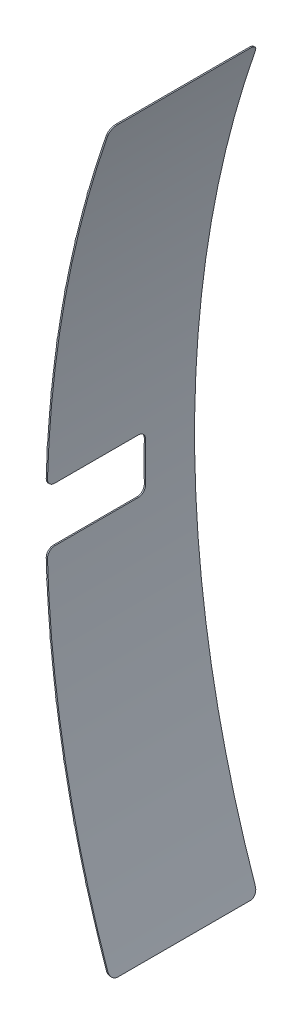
ISO-10303-21;
HEADER;
FILE_DESCRIPTION(('STEP AP214'),'2;1');
FILE_NAME('part.step','',(''),(''),'','','');
FILE_SCHEMA(('AUTOMOTIVE_DESIGN { 1 0 10303 214 1 1 1 1 }'));
ENDSEC;
DATA;
#1=APPLICATION_CONTEXT('core data for automotive mechanical design processes');
#2=APPLICATION_PROTOCOL_DEFINITION('international standard','automotive_design',2000,#1);
#3=PRODUCT_CONTEXT('',#1,'mechanical');
#4=PRODUCT('Part','Part','',(#3));
#5=PRODUCT_RELATED_PRODUCT_CATEGORY('part','',(#4));
#6=PRODUCT_DEFINITION_FORMATION('','',#4);
#7=PRODUCT_DEFINITION_CONTEXT('part definition',#1,'design');
#8=PRODUCT_DEFINITION('design','',#6,#7);
#9=PRODUCT_DEFINITION_SHAPE('','',#8);
#10=(LENGTH_UNIT() NAMED_UNIT(*) SI_UNIT(.MILLI.,.METRE.));
#11=(NAMED_UNIT(*) PLANE_ANGLE_UNIT() SI_UNIT($,.RADIAN.));
#12=(NAMED_UNIT(*) SI_UNIT($,.STERADIAN.) SOLID_ANGLE_UNIT());
#13=UNCERTAINTY_MEASURE_WITH_UNIT(LENGTH_MEASURE(1.E-05),#10,'distance_accuracy_value','');
#14=(GEOMETRIC_REPRESENTATION_CONTEXT(3) GLOBAL_UNCERTAINTY_ASSIGNED_CONTEXT((#13)) GLOBAL_UNIT_ASSIGNED_CONTEXT((#10,
#11,#12)) REPRESENTATION_CONTEXT('',''));
#15=CARTESIAN_POINT('',(0.,0.,0.));
#16=DIRECTION('',(0.,0.,1.));
#17=DIRECTION('',(1.,0.,0.));
#18=AXIS2_PLACEMENT_3D('',#15,#16,#17);
#19=CARTESIAN_POINT('',(0.,0.,6.));
#20=DIRECTION('',(0.,0.,-1.));
#21=DIRECTION('',(-1.,0.,0.));
#22=AXIS2_PLACEMENT_3D('',#19,#20,#21);
#23=CYLINDRICAL_SURFACE('',#22,45.05);
#24=CARTESIAN_POINT('',(0.,0.,6.));
#25=DIRECTION('',(0.,0.,1.));
#26=DIRECTION('',(1.,0.,0.));
#27=AXIS2_PLACEMENT_3D('',#24,#25,#26);
#28=CIRCLE('',#27,45.05);
#29=CARTESIAN_POINT('',(-44.9868555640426,2.38439226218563,6.));
#30=VERTEX_POINT('',#29);
#31=CARTESIAN_POINT('',(-45.0282411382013,1.4,6.));
#32=VERTEX_POINT('',#31);
#33=EDGE_CURVE('E1098',#30,#32,#28,.T.);
#34=ORIENTED_EDGE('',*,*,#33,.F.);
#35=DIRECTION('',(0.,0.,-1.));
#36=VECTOR('',#35,1.);
#37=CARTESIAN_POINT('',(-44.9868555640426,2.38439226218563,6.));
#38=LINE('',#37,#36);
#39=CARTESIAN_POINT('',(-44.9868555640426,2.38439226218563,2.));
#40=VERTEX_POINT('',#39);
#41=EDGE_CURVE('E961',#30,#40,#38,.T.);
#42=ORIENTED_EDGE('',*,*,#41,.T.);
#43=CARTESIAN_POINT('',(0.,0.,2.));
#44=DIRECTION('',(0.,0.,-1.));
#45=DIRECTION('',(-0.998353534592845,0.0573604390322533,0.));
#46=AXIS2_PLACEMENT_3D('',#43,#44,#45);
#47=CIRCLE('',#46,45.05);
#48=CARTESIAN_POINT('',(-44.9758267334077,2.58408777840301,2.));
#49=VERTEX_POINT('',#48);
#50=EDGE_CURVE('E945',#40,#49,#47,.T.);
#51=ORIENTED_EDGE('',*,*,#50,.T.);
#52=DIRECTION('',(0.,0.,1.));
#53=VECTOR('',#52,1.);
#54=CARTESIAN_POINT('',(-44.9758267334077,2.58408777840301,2.));
#55=LINE('',#54,#53);
#56=CARTESIAN_POINT('',(-44.9758267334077,2.58408777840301,6.));
#57=VERTEX_POINT('',#56);
#58=EDGE_CURVE('E951',#49,#57,#55,.T.);
#59=ORIENTED_EDGE('',*,*,#58,.T.);
#60=CARTESIAN_POINT('',(-44.8367093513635,4.37858362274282,6.));
#61=VERTEX_POINT('',#60);
#62=EDGE_CURVE('E977',#61,#57,#28,.T.);
#63=ORIENTED_EDGE('',*,*,#62,.F.);
#64=DIRECTION('',(0.,0.,-1.));
#65=VECTOR('',#64,1.);
#66=CARTESIAN_POINT('',(-44.8367093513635,4.37858362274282,5.99999999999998));
#67=LINE('',#66,#65);
#68=CARTESIAN_POINT('',(-44.8367093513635,4.37858362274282,1.99999999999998));
#69=VERTEX_POINT('',#68);
#70=EDGE_CURVE('E957',#61,#69,#67,.T.);
#71=ORIENTED_EDGE('',*,*,#70,.T.);
#72=CARTESIAN_POINT('',(0.,0.,1.99999999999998));
#73=DIRECTION('',(0.,0.,-1.));
#74=DIRECTION('',(-0.99482416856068,0.101611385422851,0.));
#75=AXIS2_PLACEMENT_3D('',#72,#73,#74);
#76=CIRCLE('',#75,45.05);
#77=CARTESIAN_POINT('',(-44.8168287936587,4.57759291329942,1.99999999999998));
#78=VERTEX_POINT('',#77);
#79=EDGE_CURVE('E1004',#69,#78,#76,.T.);
#80=ORIENTED_EDGE('',*,*,#79,.T.);
#81=DIRECTION('',(0.,0.,1.));
#82=VECTOR('',#81,1.);
#83=CARTESIAN_POINT('',(-44.8168287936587,4.57759291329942,1.99999999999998));
#84=LINE('',#83,#82);
#85=CARTESIAN_POINT('',(-44.8168287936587,4.57759291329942,6.));
#86=VERTEX_POINT('',#85);
#87=EDGE_CURVE('E999',#78,#86,#84,.T.);
#88=ORIENTED_EDGE('',*,*,#87,.T.);
#89=CARTESIAN_POINT('',(-44.5982077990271,6.36414653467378,6.));
#90=VERTEX_POINT('',#89);
#91=EDGE_CURVE('E988',#90,#86,#28,.T.);
#92=ORIENTED_EDGE('',*,*,#91,.F.);
#93=DIRECTION('',(0.,0.,-1.));
#94=VECTOR('',#93,1.);
#95=CARTESIAN_POINT('',(-44.5982077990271,6.36414653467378,5.99999999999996));
#96=LINE('',#95,#94);
#97=CARTESIAN_POINT('',(-44.5982077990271,6.36414653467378,1.99999999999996));
#98=VERTEX_POINT('',#97);
#99=EDGE_CURVE('E1003',#90,#98,#96,.T.);
#100=ORIENTED_EDGE('',*,*,#99,.T.);
#101=CARTESIAN_POINT('',(0.,0.,1.99999999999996));
#102=DIRECTION('',(0.,0.,-1.));
#103=DIRECTION('',(-0.989334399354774,0.145662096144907,0.));
#104=AXIS2_PLACEMENT_3D('',#101,#102,#103);
#105=CIRCLE('',#104,45.05);
#106=CARTESIAN_POINT('',(-44.5695146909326,6.56207743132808,1.99999999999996));
#107=VERTEX_POINT('',#106);
#108=EDGE_CURVE('E1041',#98,#107,#105,.T.);
#109=ORIENTED_EDGE('',*,*,#108,.T.);
#110=DIRECTION('',(0.,0.,1.));
#111=VECTOR('',#110,1.);
#112=CARTESIAN_POINT('',(-44.5695146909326,6.56207743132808,1.99999999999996));
#113=LINE('',#112,#111);
#114=CARTESIAN_POINT('',(-44.5695146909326,6.56207743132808,6.));
#115=VERTEX_POINT('',#114);
#116=EDGE_CURVE('E1037',#107,#115,#113,.T.);
#117=ORIENTED_EDGE('',*,*,#116,.T.);
#118=CARTESIAN_POINT('',(-44.2718208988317,8.33716824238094,6.));
#119=VERTEX_POINT('',#118);
#120=EDGE_CURVE('E1026',#119,#115,#28,.T.);
#121=ORIENTED_EDGE('',*,*,#120,.F.);
#122=DIRECTION('',(0.,0.,-1.));
#123=VECTOR('',#122,1.);
#124=CARTESIAN_POINT('',(-44.2718208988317,8.33716824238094,5.99999999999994));
#125=LINE('',#124,#123);
#126=CARTESIAN_POINT('',(-44.2718208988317,8.33716824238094,1.99999999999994));
#127=VERTEX_POINT('',#126);
#128=EDGE_CURVE('E530',#119,#127,#125,.T.);
#129=ORIENTED_EDGE('',*,*,#128,.T.);
#130=CARTESIAN_POINT('',(0.,0.,1.99999999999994));
#131=DIRECTION('',(0.,0.,-1.));
#132=DIRECTION('',(-0.981895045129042,0.189425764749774,0.));
#133=AXIS2_PLACEMENT_3D('',#130,#131,#132);
#134=CIRCLE('',#133,45.05);
#135=CARTESIAN_POINT('',(-44.2343717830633,8.53363070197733,1.99999999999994));
#136=VERTEX_POINT('',#135);
#137=EDGE_CURVE('E1076',#127,#136,#134,.T.);
#138=ORIENTED_EDGE('',*,*,#137,.T.);
#139=DIRECTION('',(0.,0.,1.));
#140=VECTOR('',#139,1.);
#141=CARTESIAN_POINT('',(-44.2343717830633,8.53363070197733,1.99999999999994));
#142=LINE('',#141,#140);
#143=CARTESIAN_POINT('',(-44.2343717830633,8.53363070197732,6.));
#144=VERTEX_POINT('',#143);
#145=EDGE_CURVE('E1072',#136,#144,#142,.T.);
#146=ORIENTED_EDGE('',*,*,#145,.T.);
#147=CARTESIAN_POINT('',(-43.8581918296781,10.2937607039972,6.));
#148=VERTEX_POINT('',#147);
#149=EDGE_CURVE('E1062',#148,#144,#28,.T.);
#150=ORIENTED_EDGE('',*,*,#149,.F.);
#151=DIRECTION('',(0.,0.,-1.));
#152=VECTOR('',#151,1.);
#153=CARTESIAN_POINT('',(-43.8581918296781,10.2937607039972,5.99999999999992));
#154=LINE('',#153,#152);
#155=CARTESIAN_POINT('',(-43.8581918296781,10.2937607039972,1.99999999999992));
#156=VERTEX_POINT('',#155);
#157=EDGE_CURVE('E1075',#148,#156,#154,.T.);
#158=ORIENTED_EDGE('',*,*,#157,.T.);
#159=CARTESIAN_POINT('',(0.,0.,1.99999999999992));
#160=DIRECTION('',(0.,0.,-1.));
#161=DIRECTION('',(-0.972520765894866,0.232816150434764,0.));
#162=AXIS2_PLACEMENT_3D('',#159,#160,#161);
#163=CIRCLE('',#162,45.05);
#164=CARTESIAN_POINT('',(-43.8120605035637,10.4883675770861,1.99999999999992));
#165=VERTEX_POINT('',#164);
#166=EDGE_CURVE('E1655',#156,#165,#163,.T.);
#167=ORIENTED_EDGE('',*,*,#166,.T.);
#168=DIRECTION('',(0.,0.,1.));
#169=VECTOR('',#168,1.);
#170=CARTESIAN_POINT('',(-43.8120605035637,10.4883675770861,1.99999999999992));
#171=LINE('',#170,#169);
#172=CARTESIAN_POINT('',(-43.8120605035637,10.4883675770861,6.));
#173=VERTEX_POINT('',#172);
#174=EDGE_CURVE('E1232',#165,#173,#171,.T.);
#175=ORIENTED_EDGE('',*,*,#174,.T.);
#176=CARTESIAN_POINT('',(-43.3581356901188,12.2300682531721,6.));
#177=VERTEX_POINT('',#176);
#178=EDGE_CURVE('E1094',#177,#173,#28,.T.);
#179=ORIENTED_EDGE('',*,*,#178,.F.);
#180=DIRECTION('',(0.,0.,-1.));
#181=VECTOR('',#180,1.);
#182=CARTESIAN_POINT('',(-43.3581356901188,12.2300682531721,5.9999999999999));
#183=LINE('',#182,#181);
#184=CARTESIAN_POINT('',(-43.3581356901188,12.2300682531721,1.9999999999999));
#185=VERTEX_POINT('',#184);
#186=EDGE_CURVE('E1229',#177,#185,#183,.T.);
#187=ORIENTED_EDGE('',*,*,#186,.T.);
#188=CARTESIAN_POINT('',(0.,0.,1.9999999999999));
#189=DIRECTION('',(0.,0.,-1.));
#190=DIRECTION('',(-0.961230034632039,0.275747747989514,0.));
#191=AXIS2_PLACEMENT_3D('',#188,#189,#190);
#192=CIRCLE('',#191,45.05);
#193=CARTESIAN_POINT('',(-43.3034130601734,12.4224360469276,1.9999999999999));
#194=VERTEX_POINT('',#193);
#195=EDGE_CURVE('E1225',#185,#194,#192,.T.);
#196=ORIENTED_EDGE('',*,*,#195,.T.);
#197=DIRECTION('',(0.,0.,1.));
#198=VECTOR('',#197,1.);
#199=CARTESIAN_POINT('',(-43.3034130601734,12.4224360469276,1.9999999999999));
#200=LINE('',#199,#198);
#201=CARTESIAN_POINT('',(-43.3034130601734,12.4224360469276,6.));
#202=VERTEX_POINT('',#201);
#203=EDGE_CURVE('E1220',#194,#202,#200,.T.);
#204=ORIENTED_EDGE('',*,*,#203,.T.);
#205=CARTESIAN_POINT('',(-42.5841813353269,14.7,6.));
#206=VERTEX_POINT('',#205);
#207=EDGE_CURVE('E1112',#206,#202,#28,.T.);
#208=ORIENTED_EDGE('',*,*,#207,.F.);
#209=CARTESIAN_POINT('',(-42.5841813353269,14.7,6.));
#210=CARTESIAN_POINT('',(-42.5780912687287,14.7176435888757,6.00001047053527));
#211=CARTESIAN_POINT('',(-42.5719889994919,14.7352842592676,5.99844396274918));
#212=CARTESIAN_POINT('',(-42.5599276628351,14.7700841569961,5.99223149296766));
#213=CARTESIAN_POINT('',(-42.5539687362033,14.7872429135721,5.98758262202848));
#214=CARTESIAN_POINT('',(-42.5423680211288,14.8205849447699,5.97527400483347));
#215=CARTESIAN_POINT('',(-42.5367265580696,14.8367672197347,5.96761123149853));
#216=CARTESIAN_POINT('',(-42.5259502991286,14.8676264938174,5.94944240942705));
#217=CARTESIAN_POINT('',(-42.5208151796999,14.8823044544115,5.93893819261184));
#218=CARTESIAN_POINT('',(-42.511362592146,14.9092840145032,5.91565912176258));
#219=CARTESIAN_POINT('',(-42.5070264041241,14.9216402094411,5.90295528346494));
#220=CARTESIAN_POINT('',(-42.4991634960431,14.9440203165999,5.87540998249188));
#221=CARTESIAN_POINT('',(-42.4956367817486,14.9540442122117,5.86056850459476));
#222=CARTESIAN_POINT('',(-42.4897118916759,14.9708703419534,5.83006126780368));
#223=CARTESIAN_POINT('',(-42.4872619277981,14.9778205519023,5.81448703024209));
#224=CARTESIAN_POINT('',(-42.4833208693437,14.9889954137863,5.78228609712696));
#225=CARTESIAN_POINT('',(-42.4818283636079,14.99322407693,5.76566099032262));
#226=CARTESIAN_POINT('',(-42.4803770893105,14.9973352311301,5.7407286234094));
#227=CARTESIAN_POINT('',(-42.4800244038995,14.9983341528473,5.73261314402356));
#228=CARTESIAN_POINT('',(-42.4795541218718,14.9996660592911,5.71633322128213));
#229=CARTESIAN_POINT('',(-42.4794361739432,15.0000000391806,5.70816886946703));
#230=CARTESIAN_POINT('',(-42.4794362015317,15.,5.70000000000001));
#231=B_SPLINE_CURVE_WITH_KNOTS('',3,(#209,#210,#211,#212,#213,#214,#215,#216,#217,#218,#219,
#220,#221,#222,#223,#224,#225,#226,#227,#228,#229,#230),.UNSPECIFIED.,.F.,.F.,(4,2,2,2,2,2,2,2,
2,2,4),(0.,0.0559326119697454,0.111918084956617,0.167959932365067,0.223965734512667,
0.278419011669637,0.332872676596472,0.384302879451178,0.435657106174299,0.460183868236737,
0.484673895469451),.UNSPECIFIED.);
#232=CARTESIAN_POINT('',(-42.4794362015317,15.,5.7));
#233=VERTEX_POINT('',#232);
#234=EDGE_CURVE('E1224',#206,#233,#231,.T.);
#235=ORIENTED_EDGE('',*,*,#234,.T.);
#236=DIRECTION('',(0.,0.,-1.));
#237=VECTOR('',#236,1.);
#238=CARTESIAN_POINT('',(-42.4794362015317,15.,6.));
#239=LINE('',#238,#237);
#240=CARTESIAN_POINT('',(-42.4794362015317,15.,0.3));
#241=VERTEX_POINT('',#240);
#242=EDGE_CURVE('E1973',#233,#241,#239,.T.);
#243=ORIENTED_EDGE('',*,*,#242,.T.);
#244=CARTESIAN_POINT('',(-42.4794362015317,15.,0.3));
#245=CARTESIAN_POINT('',(-42.4794298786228,15.000017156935,0.283811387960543));
#246=CARTESIAN_POINT('',(-42.4798984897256,14.9986908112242,0.267632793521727));
#247=CARTESIAN_POINT('',(-42.4817365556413,14.9934843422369,0.235782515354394));
#248=CARTESIAN_POINT('',(-42.4831038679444,14.9896102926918,0.220109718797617));
#249=CARTESIAN_POINT('',(-42.4866905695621,14.9794409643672,0.189678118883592));
#250=CARTESIAN_POINT('',(-42.4889098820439,14.9731459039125,0.174919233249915));
#251=CARTESIAN_POINT('',(-42.4941171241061,14.9583612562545,0.146692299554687));
#252=CARTESIAN_POINT('',(-42.4971052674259,14.9498710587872,0.133224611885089));
#253=CARTESIAN_POINT('',(-42.5038299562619,14.930741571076,0.107593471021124));
#254=CARTESIAN_POINT('',(-42.5075828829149,14.9200551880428,0.0954695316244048));
#255=CARTESIAN_POINT('',(-42.5156689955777,14.8969976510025,0.0731757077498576));
#256=CARTESIAN_POINT('',(-42.5200023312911,14.8846260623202,0.0630063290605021));
#257=CARTESIAN_POINT('',(-42.5293703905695,14.8578385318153,0.044328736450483));
#258=CARTESIAN_POINT('',(-42.5344303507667,14.8433482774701,0.0359398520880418));
#259=CARTESIAN_POINT('',(-42.5449099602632,14.8132842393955,0.0217136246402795));
#260=CARTESIAN_POINT('',(-42.550329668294,14.7977102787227,0.0158766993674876));
#261=CARTESIAN_POINT('',(-42.5604846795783,14.7684746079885,0.0075907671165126));
#262=CARTESIAN_POINT('',(-42.5651884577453,14.7549123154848,0.00474587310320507));
#263=CARTESIAN_POINT('',(-42.5746573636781,14.7275681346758,0.0009503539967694));
#264=CARTESIAN_POINT('',(-42.5794223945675,14.7137865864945,-2.9621701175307E-06));
#265=CARTESIAN_POINT('',(-42.5841813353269,14.7,0.));
#266=B_SPLINE_CURVE_WITH_KNOTS('',3,(#244,#245,#246,#247,#248,#249,#250,#251,#252,#253,#254,
#255,#256,#257,#258,#259,#260,#261,#262,#263,#264,#265),.UNSPECIFIED.,.F.,.F.,(4,2,2,2,2,2,2,2,
2,2,4),(0.,0.0484894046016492,0.0968636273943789,0.145233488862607,0.193616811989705,
0.243172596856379,0.292741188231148,0.344985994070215,0.397239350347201,0.441019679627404,
0.484737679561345),.UNSPECIFIED.);
#267=CARTESIAN_POINT('',(-42.5841813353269,14.7,0.));
#268=VERTEX_POINT('',#267);
#269=EDGE_CURVE('E1823',#241,#268,#266,.T.);
#270=ORIENTED_EDGE('',*,*,#269,.T.);
#271=CARTESIAN_POINT('',(0.,0.,0.));
#272=DIRECTION('',(0.,0.,1.));
#273=DIRECTION('',(1.,0.,0.));
#274=AXIS2_PLACEMENT_3D('',#271,#272,#273);
#275=CIRCLE('',#274,45.05);
#276=CARTESIAN_POINT('',(-44.9404229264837,3.14020495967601,0.));
#277=VERTEX_POINT('',#276);
#278=EDGE_CURVE('E1569',#268,#277,#275,.T.);
#279=ORIENTED_EDGE('',*,*,#278,.T.);
#280=CARTESIAN_POINT('',(-45.049773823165,0.142753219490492,2.));
#281=CARTESIAN_POINT('',(-45.0466050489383,1.14274861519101,1.33333305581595));
#282=CARTESIAN_POINT('',(-45.010127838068,2.14263688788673,0.666666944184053));
#283=CARTESIAN_POINT('',(-44.9404229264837,3.14020495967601,0.));
#284=B_SPLINE_CURVE_WITH_KNOTS('',3,(#280,#281,#282,#283),.UNSPECIFIED.,.F.,.F.,(4,4),(0.,1.),.UNSPECIFIED.);
#285=CARTESIAN_POINT('',(-45.049773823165,0.142753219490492,2.));
#286=VERTEX_POINT('',#285);
#287=EDGE_CURVE('E1578',#277,#286,#284,.F.);
#288=ORIENTED_EDGE('',*,*,#287,.T.);
#289=CARTESIAN_POINT('',(0.,0.,2.));
#290=DIRECTION('',(0.,0.,-1.));
#291=DIRECTION('',(-1.,0.,0.));
#292=AXIS2_PLACEMENT_3D('',#289,#290,#291);
#293=CIRCLE('',#292,45.05);
#294=CARTESIAN_POINT('',(-45.0428962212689,0.8,2.));
#295=VERTEX_POINT('',#294);
#296=EDGE_CURVE('E1587',#286,#295,#293,.T.);
#297=ORIENTED_EDGE('',*,*,#296,.T.);
#298=CARTESIAN_POINT('',(-45.0428962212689,0.8,2.));
#299=CARTESIAN_POINT('',(-45.0425967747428,0.816880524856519,1.99998568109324));
#300=CARTESIAN_POINT('',(-45.0422871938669,0.833756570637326,2.00142390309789));
#301=CARTESIAN_POINT('',(-45.041659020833,0.86701807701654,2.00709957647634));
#302=CARTESIAN_POINT('',(-45.0413404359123,0.883403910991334,2.01133483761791));
#303=CARTESIAN_POINT('',(-45.0407048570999,0.91523886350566,2.02250171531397));
#304=CARTESIAN_POINT('',(-45.0403878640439,0.93068752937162,2.0294346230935));
#305=CARTESIAN_POINT('',(-45.0397683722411,0.960199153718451,2.04579405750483));
#306=CARTESIAN_POINT('',(-45.0394658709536,0.974262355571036,2.05522014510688));
#307=CARTESIAN_POINT('',(-45.0388883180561,1.00060639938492,2.07629995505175));
#308=CARTESIAN_POINT('',(-45.0386132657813,1.01288728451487,2.08795362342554));
#309=CARTESIAN_POINT('',(-45.0381031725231,1.0353206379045,2.11316085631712));
#310=CARTESIAN_POINT('',(-45.0378681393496,1.0454726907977,2.12671479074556));
#311=CARTESIAN_POINT('',(-45.0374494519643,1.06335656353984,2.15533428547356));
#312=CARTESIAN_POINT('',(-45.0372657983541,1.0710883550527,2.17039986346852));
#313=CARTESIAN_POINT('',(-45.0369590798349,1.08390876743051,2.20161286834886));
#314=CARTESIAN_POINT('',(-45.0368359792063,1.08899894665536,2.21775965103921));
#315=CARTESIAN_POINT('',(-45.0366873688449,1.09512406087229,2.2450047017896));
#316=CARTESIAN_POINT('',(-45.0366428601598,1.09695143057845,2.25593128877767));
#317=CARTESIAN_POINT('',(-45.0365833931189,1.09938923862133,2.27790371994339));
#318=CARTESIAN_POINT('',(-45.0365683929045,1.10000140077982,2.28894937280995));
#319=CARTESIAN_POINT('',(-45.0365684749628,1.10000000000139,2.29999999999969));
#320=B_SPLINE_CURVE_WITH_KNOTS('',3,(#298,#299,#300,#301,#302,#303,#304,#305,#306,#307,#308,
#309,#310,#311,#312,#313,#314,#315,#316,#317,#318,#319),.UNSPECIFIED.,.F.,.F.,(4,2,2,2,2,2,2,2,
2,2,4),(0.,0.0505822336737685,0.101124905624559,0.151691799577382,0.202249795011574,
0.252806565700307,0.303373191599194,0.353940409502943,0.404477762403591,0.437650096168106,
0.4707753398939),.UNSPECIFIED.);
#321=CARTESIAN_POINT('',(-45.0365684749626,1.1,2.3));
#322=VERTEX_POINT('',#321);
#323=EDGE_CURVE('E2590',#295,#322,#320,.T.);
#324=ORIENTED_EDGE('',*,*,#323,.T.);
#325=DIRECTION('',(0.,0.,-1.));
#326=VECTOR('',#325,1.);
#327=CARTESIAN_POINT('',(-45.0365684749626,1.1,6.));
#328=LINE('',#327,#326);
#329=CARTESIAN_POINT('',(-45.0365684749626,1.1,5.7));
#330=VERTEX_POINT('',#329);
#331=EDGE_CURVE('E1131',#322,#330,#328,.F.);
#332=ORIENTED_EDGE('',*,*,#331,.T.);
#333=CARTESIAN_POINT('',(-45.0365684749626,1.1,5.7));
#334=CARTESIAN_POINT('',(-45.0365685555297,1.0999856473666,5.71687353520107));
#335=CARTESIAN_POINT('',(-45.0365337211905,1.1014227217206,5.73374276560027));
#336=CARTESIAN_POINT('',(-45.0363948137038,1.10709378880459,5.76699097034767));
#337=CARTESIAN_POINT('',(-45.0362907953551,1.11132556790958,5.78337032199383));
#338=CARTESIAN_POINT('',(-45.0360140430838,1.12248308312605,5.81519290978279));
#339=CARTESIAN_POINT('',(-45.0358412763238,1.12941010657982,5.83063569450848));
#340=CARTESIAN_POINT('',(-45.0354284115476,1.14575512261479,5.86013649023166));
#341=CARTESIAN_POINT('',(-45.0351883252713,1.15517268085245,5.87419474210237));
#342=CARTESIAN_POINT('',(-45.034643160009,1.17623380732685,5.90053198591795));
#343=CARTESIAN_POINT('',(-45.0343380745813,1.18787759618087,5.91281080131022));
#344=CARTESIAN_POINT('',(-45.0336667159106,1.2130624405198,5.93524181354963));
#345=CARTESIAN_POINT('',(-45.0333004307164,1.22660386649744,5.94539359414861));
#346=CARTESIAN_POINT('',(-45.0325123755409,1.25520264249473,5.96328400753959));
#347=CARTESIAN_POINT('',(-45.0320905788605,1.27026072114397,5.97102147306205));
#348=CARTESIAN_POINT('',(-45.0311997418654,1.30145788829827,5.98385473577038));
#349=CARTESIAN_POINT('',(-45.0307307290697,1.31759634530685,5.98895206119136));
#350=CARTESIAN_POINT('',(-45.0299230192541,1.34486073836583,5.99509831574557));
#351=CARTESIAN_POINT('',(-45.0295945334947,1.35581581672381,5.99693536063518));
#352=CARTESIAN_POINT('',(-45.0289258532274,1.37784578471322,5.99938604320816));
#353=CARTESIAN_POINT('',(-45.0285856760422,1.38892048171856,6.00000141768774));
#354=CARTESIAN_POINT('',(-45.0282411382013,1.39999999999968,6.00000000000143));
#355=B_SPLINE_CURVE_WITH_KNOTS('',3,(#333,#334,#335,#336,#337,#338,#339,#340,#341,#342,#343,
#344,#345,#346,#347,#348,#349,#350,#351,#352,#353,#354),.UNSPECIFIED.,.F.,.F.,(4,2,2,2,2,2,2,2,
2,2,4),(0.,0.0505533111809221,0.1010666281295,0.151604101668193,0.202132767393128,
0.252666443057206,0.303209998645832,0.353777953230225,0.404316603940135,0.437591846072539,
0.47081974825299),.UNSPECIFIED.);
#356=EDGE_CURVE('E1123',#330,#32,#355,.T.);
#357=ORIENTED_EDGE('',*,*,#356,.T.);
#358=EDGE_LOOP('',(#34,#42,#51,#59,#63,#71,#80,#88,#92,#100,#109,#117,#121,#129,#138,#146,#150,
#158,#167,#175,#179,#187,#196,#204,#208,#235,#243,#270,#279,#288,#297,#324,#332,#357));
#359=FACE_BOUND('',#358,.T.);
#360=ADVANCED_FACE('F526',(#359),#23,.T.);
#361=CARTESIAN_POINT('',(0.,0.,6.));
#362=DIRECTION('',(0.,0.,1.));
#363=DIRECTION('',(1.,0.,0.));
#364=AXIS2_PLACEMENT_3D('',#361,#362,#363);
#365=PLANE('',#364);
#366=ORIENTED_EDGE('',*,*,#207,.T.);
#367=DIRECTION('',(0.961230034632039,-0.275747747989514,0.));
#368=VECTOR('',#367,1.);
#369=CARTESIAN_POINT('',(-43.3034130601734,12.4224360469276,6.));
#370=LINE('',#369,#368);
#371=CARTESIAN_POINT('',(-43.3130253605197,12.4251935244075,6.));
#372=VERTEX_POINT('',#371);
#373=EDGE_CURVE('E1201',#372,#202,#370,.T.);
#374=ORIENTED_EDGE('',*,*,#373,.F.);
#375=CARTESIAN_POINT('',(0.,0.,6.));
#376=DIRECTION('',(0.,0.,-1.));
#377=DIRECTION('',(-1.,0.,0.));
#378=AXIS2_PLACEMENT_3D('',#375,#376,#377);
#379=CIRCLE('',#378,45.06);
#380=CARTESIAN_POINT('',(-43.3677601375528,12.2327830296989,6.));
#381=VERTEX_POINT('',#380);
#382=EDGE_CURVE('E1122',#372,#381,#379,.F.);
#383=ORIENTED_EDGE('',*,*,#382,.T.);
#384=DIRECTION('',(0.962444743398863,-0.271477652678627,0.));
#385=VECTOR('',#384,1.);
#386=CARTESIAN_POINT('',(-43.3581356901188,12.2300682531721,6.));
#387=LINE('',#386,#385);
#388=EDGE_CURVE('E1129',#381,#177,#387,.T.);
#389=ORIENTED_EDGE('',*,*,#388,.T.);
#390=ORIENTED_EDGE('',*,*,#178,.T.);
#391=DIRECTION('',(0.972520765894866,-0.232816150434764,0.));
#392=VECTOR('',#391,1.);
#393=CARTESIAN_POINT('',(-43.8120605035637,10.4883675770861,6.));
#394=LINE('',#393,#392);
#395=CARTESIAN_POINT('',(-43.8217857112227,10.4906957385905,6.));
#396=VERTEX_POINT('',#395);
#397=EDGE_CURVE('E1065',#396,#173,#394,.T.);
#398=ORIENTED_EDGE('',*,*,#397,.F.);
#399=CARTESIAN_POINT('',(0.,0.,6.));
#400=DIRECTION('',(0.,0.,-1.));
#401=DIRECTION('',(-1.,0.,0.));
#402=AXIS2_PLACEMENT_3D('',#399,#400,#401);
#403=CIRCLE('',#402,45.06);
#404=CARTESIAN_POINT('',(-43.867927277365,10.2960456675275,6.));
#405=VERTEX_POINT('',#404);
#406=EDGE_CURVE('E1192',#396,#405,#403,.F.);
#407=ORIENTED_EDGE('',*,*,#406,.T.);
#408=DIRECTION('',(0.973544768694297,-0.228496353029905,0.));
#409=VECTOR('',#408,1.);
#410=CARTESIAN_POINT('',(-43.8581918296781,10.2937607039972,6.));
#411=LINE('',#410,#409);
#412=EDGE_CURVE('E1093',#405,#148,#411,.T.);
#413=ORIENTED_EDGE('',*,*,#412,.T.);
#414=ORIENTED_EDGE('',*,*,#149,.T.);
#415=DIRECTION('',(0.981895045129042,-0.189425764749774,0.));
#416=VECTOR('',#415,1.);
#417=CARTESIAN_POINT('',(-44.2343717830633,8.53363070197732,6.));
#418=LINE('',#417,#416);
#419=CARTESIAN_POINT('',(-44.2441907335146,8.53552495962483,6.));
#420=VERTEX_POINT('',#419);
#421=EDGE_CURVE('E1030',#420,#144,#418,.T.);
#422=ORIENTED_EDGE('',*,*,#421,.F.);
#423=CARTESIAN_POINT('',(0.,0.,6.));
#424=DIRECTION('',(0.,0.,-1.));
#425=DIRECTION('',(-1.,0.,0.));
#426=AXIS2_PLACEMENT_3D('',#423,#424,#425);
#427=CIRCLE('',#426,45.06);
#428=CARTESIAN_POINT('',(-44.2816481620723,8.33901889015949,6.));
#429=VERTEX_POINT('',#428);
#430=EDGE_CURVE('E1053',#420,#429,#427,.F.);
#431=ORIENTED_EDGE('',*,*,#430,.T.);
#432=DIRECTION('',(0.982726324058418,-0.185064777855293,0.));
#433=VECTOR('',#432,1.);
#434=CARTESIAN_POINT('',(-44.2718208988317,8.33716824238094,6.));
#435=LINE('',#434,#433);
#436=EDGE_CURVE('E1051',#429,#119,#435,.T.);
#437=ORIENTED_EDGE('',*,*,#436,.T.);
#438=ORIENTED_EDGE('',*,*,#120,.T.);
#439=DIRECTION('',(0.989334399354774,-0.145662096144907,0.));
#440=VECTOR('',#439,1.);
#441=CARTESIAN_POINT('',(-44.5695146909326,6.56207743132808,6.));
#442=LINE('',#441,#440);
#443=CARTESIAN_POINT('',(-44.5794080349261,6.56353405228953,6.));
#444=VERTEX_POINT('',#443);
#445=EDGE_CURVE('E992',#444,#115,#442,.T.);
#446=ORIENTED_EDGE('',*,*,#445,.F.);
#447=CARTESIAN_POINT('',(0.,0.,6.));
#448=DIRECTION('',(0.,0.,-1.));
#449=DIRECTION('',(-1.,0.,0.));
#450=AXIS2_PLACEMENT_3D('',#447,#448,#449);
#451=CIRCLE('',#450,45.06);
#452=CARTESIAN_POINT('',(-44.60810751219,6.36555921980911,6.));
#453=VERTEX_POINT('',#452);
#454=EDGE_CURVE('E1016',#444,#453,#451,.F.);
#455=ORIENTED_EDGE('',*,*,#454,.T.);
#456=DIRECTION('',(0.989971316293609,-0.141268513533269,0.));
#457=VECTOR('',#456,1.);
#458=CARTESIAN_POINT('',(-44.5982077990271,6.36414653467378,6.));
#459=LINE('',#458,#457);
#460=EDGE_CURVE('E1013',#453,#90,#459,.T.);
#461=ORIENTED_EDGE('',*,*,#460,.T.);
#462=ORIENTED_EDGE('',*,*,#91,.T.);
#463=DIRECTION('',(0.99482416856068,-0.101611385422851,0.));
#464=VECTOR('',#463,1.);
#465=CARTESIAN_POINT('',(-44.8168287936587,4.57759291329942,6.));
#466=LINE('',#465,#464);
#467=CARTESIAN_POINT('',(-44.8267770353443,4.57860902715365,6.));
#468=VERTEX_POINT('',#467);
#469=EDGE_CURVE('E970',#468,#86,#466,.T.);
#470=ORIENTED_EDGE('',*,*,#469,.F.);
#471=CARTESIAN_POINT('',(0.,0.,6.));
#472=DIRECTION('',(0.,0.,-1.));
#473=DIRECTION('',(-1.,0.,0.));
#474=AXIS2_PLACEMENT_3D('',#471,#472,#473);
#475=CIRCLE('',#474,45.06);
#476=CARTESIAN_POINT('',(-44.8466620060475,4.37955556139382,6.));
#477=VERTEX_POINT('',#476);
#478=EDGE_CURVE('E978',#468,#477,#475,.F.);
#479=ORIENTED_EDGE('',*,*,#478,.T.);
#480=DIRECTION('',(0.995265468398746,-0.0971938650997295,0.));
#481=VECTOR('',#480,1.);
#482=CARTESIAN_POINT('',(-44.8367093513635,4.37858362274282,6.));
#483=LINE('',#482,#481);
#484=EDGE_CURVE('E974',#477,#61,#483,.T.);
#485=ORIENTED_EDGE('',*,*,#484,.T.);
#486=ORIENTED_EDGE('',*,*,#62,.T.);
#487=DIRECTION('',(0.998353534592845,-0.0573604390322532,0.));
#488=VECTOR('',#487,1.);
#489=CARTESIAN_POINT('',(-44.9758267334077,2.58408777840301,6.));
#490=LINE('',#489,#488);
#491=CARTESIAN_POINT('',(-44.9858102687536,2.58466138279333,6.));
#492=VERTEX_POINT('',#491);
#493=EDGE_CURVE('E13',#492,#57,#490,.T.);
#494=ORIENTED_EDGE('',*,*,#493,.F.);
#495=CARTESIAN_POINT('',(0.,0.,6.));
#496=DIRECTION('',(0.,0.,-1.));
#497=DIRECTION('',(-1.,0.,0.));
#498=AXIS2_PLACEMENT_3D('',#495,#496,#497);
#499=CIRCLE('',#498,45.06);
#500=CARTESIAN_POINT('',(-44.9968415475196,2.38492153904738,6.));
#501=VERTEX_POINT('',#500);
#502=EDGE_CURVE('E1097',#492,#501,#499,.F.);
#503=ORIENTED_EDGE('',*,*,#502,.T.);
#504=DIRECTION('',(0.998598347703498,-0.0529276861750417,0.));
#505=VECTOR('',#504,1.);
#506=CARTESIAN_POINT('',(-44.9868555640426,2.38439226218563,6.));
#507=LINE('',#506,#505);
#508=EDGE_CURVE('E1101',#501,#30,#507,.T.);
#509=ORIENTED_EDGE('',*,*,#508,.T.);
#510=ORIENTED_EDGE('',*,*,#33,.T.);
#511=DIRECTION('',(-1.,0.,0.));
#512=VECTOR('',#511,1.);
#513=CARTESIAN_POINT('',(-44.9865535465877,1.4,6.));
#514=LINE('',#513,#512);
#515=CARTESIAN_POINT('',(-44.9782169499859,1.4,6.));
#516=VERTEX_POINT('',#515);
#517=EDGE_CURVE('E1103',#32,#516,#514,.F.);
#518=ORIENTED_EDGE('',*,*,#517,.T.);
#519=CARTESIAN_POINT('',(0.,0.,6.));
#520=DIRECTION('',(0.,0.,-1.));
#521=DIRECTION('',(1.,0.,0.));
#522=AXIS2_PLACEMENT_3D('',#519,#520,#521);
#523=CIRCLE('',#522,45.);
#524=CARTESIAN_POINT('',(-42.5312826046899,14.7,6.));
#525=VERTEX_POINT('',#524);
#526=EDGE_CURVE('E1106',#516,#525,#523,.T.);
#527=ORIENTED_EDGE('',*,*,#526,.T.);
#528=DIRECTION('',(-1.,0.,0.));
#529=VECTOR('',#528,1.);
#530=CARTESIAN_POINT('',(-42.4794362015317,14.7,6.));
#531=LINE('',#530,#529);
#532=EDGE_CURVE('E1454',#525,#206,#531,.T.);
#533=ORIENTED_EDGE('',*,*,#532,.T.);
#534=EDGE_LOOP('',(#366,#374,#383,#389,#390,#398,#407,#413,#414,#422,#431,#437,#438,#446,#455,
#461,#462,#470,#479,#485,#486,#494,#503,#509,#510,#518,#527,#533));
#535=FACE_BOUND('',#534,.T.);
#536=ADVANCED_FACE('F1432',(#535),#365,.T.);
#537=CARTESIAN_POINT('',(0.,0.,6.));
#538=DIRECTION('',(0.,0.,-1.));
#539=DIRECTION('',(-1.,0.,0.));
#540=AXIS2_PLACEMENT_3D('',#537,#538,#539);
#541=CYLINDRICAL_SURFACE('',#540,45.);
#542=ORIENTED_EDGE('',*,*,#526,.F.);
#543=CARTESIAN_POINT('',(-44.9782169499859,1.4,6.));
#544=CARTESIAN_POINT('',(-44.978742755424,1.3831190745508,6.0000143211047));
#545=CARTESIAN_POINT('',(-44.9792582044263,1.36624202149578,5.99857602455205));
#546=CARTESIAN_POINT('',(-44.9802561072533,1.33297727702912,5.99289946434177));
#547=CARTESIAN_POINT('',(-44.9807385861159,1.31658921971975,5.98866335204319));
#548=CARTESIAN_POINT('',(-44.981659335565,1.28474893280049,5.97749340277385));
#549=CARTESIAN_POINT('',(-44.9820975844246,1.26929716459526,5.97055824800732));
#550=CARTESIAN_POINT('',(-44.9829208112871,1.23977937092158,5.95419268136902));
#551=CARTESIAN_POINT('',(-44.9833057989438,1.22571309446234,5.94476272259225));
#552=CARTESIAN_POINT('',(-44.9840159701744,1.19936704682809,5.92367628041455));
#553=CARTESIAN_POINT('',(-44.9843411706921,1.18708676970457,5.91202042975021));
#554=CARTESIAN_POINT('',(-44.9849275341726,1.16465486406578,5.88680840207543));
#555=CARTESIAN_POINT('',(-44.9851886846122,1.15450365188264,5.8732518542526));
#556=CARTESIAN_POINT('',(-44.9856440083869,1.13662369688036,5.84462960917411));
#557=CARTESIAN_POINT('',(-44.985838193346,1.12889453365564,5.82956417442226));
#558=CARTESIAN_POINT('',(-44.9861579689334,1.11607909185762,5.79835187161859));
#559=CARTESIAN_POINT('',(-44.9862836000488,1.11099125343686,5.78220564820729));
#560=CARTESIAN_POINT('',(-44.9864342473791,1.10487083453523,5.75496673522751));
#561=CARTESIAN_POINT('',(-44.9864790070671,1.10304537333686,5.7440457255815));
#562=CARTESIAN_POINT('',(-44.9865386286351,1.10061012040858,5.72208467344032));
#563=CARTESIAN_POINT('',(-44.9865535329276,1.09999860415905,5.71104482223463));
#564=CARTESIAN_POINT('',(-44.9865535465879,1.0999999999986,5.70000000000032));
#565=B_SPLINE_CURVE_WITH_KNOTS('',3,(#543,#544,#545,#546,#547,#548,#549,#550,#551,#552,#553,
#554,#555,#556,#557,#558,#559,#560,#561,#562,#563,#564),.UNSPECIFIED.,.F.,.F.,(4,2,2,2,2,2,2,2,
2,2,4),(0.,0.0506002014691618,0.101161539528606,0.151747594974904,0.202324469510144,
0.252886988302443,0.303459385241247,0.354022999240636,0.404556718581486,0.437711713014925,
0.470819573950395),.UNSPECIFIED.);
#566=CARTESIAN_POINT('',(-44.9865535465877,1.1,5.7));
#567=VERTEX_POINT('',#566);
#568=EDGE_CURVE('E1443',#516,#567,#565,.T.);
#569=ORIENTED_EDGE('',*,*,#568,.T.);
#570=DIRECTION('',(0.,0.,-1.));
#571=VECTOR('',#570,1.);
#572=CARTESIAN_POINT('',(-44.9865535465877,1.1,6.));
#573=LINE('',#572,#571);
#574=CARTESIAN_POINT('',(-44.9865535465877,1.1,2.3));
#575=VERTEX_POINT('',#574);
#576=EDGE_CURVE('E1480',#567,#575,#573,.T.);
#577=ORIENTED_EDGE('',*,*,#576,.T.);
#578=CARTESIAN_POINT('',(-44.9865535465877,1.1,2.3));
#579=CARTESIAN_POINT('',(-44.9865529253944,1.1000143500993,2.28312587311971));
#580=CARTESIAN_POINT('',(-44.986588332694,1.09857717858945,2.2662560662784));
#581=CARTESIAN_POINT('',(-44.9867266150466,1.09290573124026,2.23300679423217));
#582=CARTESIAN_POINT('',(-44.9868294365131,1.0886736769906,2.21662695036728));
#583=CARTESIAN_POINT('',(-44.9870980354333,1.07751543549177,2.18480344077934));
#584=CARTESIAN_POINT('',(-44.9872638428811,1.07058796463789,2.16936022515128));
#585=CARTESIAN_POINT('',(-44.9876498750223,1.05424178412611,2.13985852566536));
#586=CARTESIAN_POINT('',(-44.987870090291,1.04482350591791,2.12579980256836));
#587=CARTESIAN_POINT('',(-44.9883543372,1.02376001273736,2.09946097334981));
#588=CARTESIAN_POINT('',(-44.9886183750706,1.01211448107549,2.08718112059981));
#589=CARTESIAN_POINT('',(-44.9891779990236,0.986925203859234,2.0647482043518));
#590=CARTESIAN_POINT('',(-44.9894735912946,0.973381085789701,2.0545955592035));
#591=CARTESIAN_POINT('',(-44.990083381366,0.944776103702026,2.03670413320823));
#592=CARTESIAN_POINT('',(-44.9903975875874,0.929714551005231,2.02896645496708));
#593=CARTESIAN_POINT('',(-44.9910315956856,0.898509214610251,2.0161336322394));
#594=CARTESIAN_POINT('',(-44.9913513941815,0.882366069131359,2.01103694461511));
#595=CARTESIAN_POINT('',(-44.9918760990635,0.855103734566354,2.00489534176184));
#596=CARTESIAN_POINT('',(-44.9920828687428,0.844155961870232,2.00306071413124));
#597=CARTESIAN_POINT('',(-44.9924905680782,0.822140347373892,2.00061320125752));
#598=CARTESIAN_POINT('',(-44.9926915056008,0.811072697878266,1.99999858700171));
#599=CARTESIAN_POINT('',(-44.9928883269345,0.800000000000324,1.99999999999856));
#600=B_SPLINE_CURVE_WITH_KNOTS('',3,(#578,#579,#580,#581,#582,#583,#584,#585,#586,#587,#588,
#589,#590,#591,#592,#593,#594,#595,#596,#597,#598,#599),.UNSPECIFIED.,.F.,.F.,(4,2,2,2,2,2,2,2,
2,2,4),(0.,0.0505550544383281,0.101069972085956,0.15160897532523,0.202139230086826,
0.252676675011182,0.303224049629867,0.353794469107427,0.404335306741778,0.437579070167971,
0.470775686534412),.UNSPECIFIED.);
#601=CARTESIAN_POINT('',(-44.9928883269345,0.8,2.));
#602=VERTEX_POINT('',#601);
#603=EDGE_CURVE('E2593',#575,#602,#600,.T.);
#604=ORIENTED_EDGE('',*,*,#603,.T.);
#605=CARTESIAN_POINT('',(0.,0.,2.));
#606=DIRECTION('',(0.,0.,-1.));
#607=DIRECTION('',(-1.,0.,0.));
#608=AXIS2_PLACEMENT_3D('',#605,#606,#607);
#609=CIRCLE('',#608,45.);
#610=CARTESIAN_POINT('',(-44.9928883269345,-0.8,2.));
#611=VERTEX_POINT('',#610);
#612=EDGE_CURVE('E1541',#602,#611,#609,.F.);
#613=ORIENTED_EDGE('',*,*,#612,.T.);
#614=CARTESIAN_POINT('',(-44.9928883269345,-0.8,2.));
#615=CARTESIAN_POINT('',(-44.9925885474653,-0.816880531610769,1.99998568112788));
#616=CARTESIAN_POINT('',(-44.9922786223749,-0.833756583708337,2.00142390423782));
#617=CARTESIAN_POINT('',(-44.9916497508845,-0.867018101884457,2.00709958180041));
#618=CARTESIAN_POINT('',(-44.9913308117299,-0.883403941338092,2.01133484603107));
#619=CARTESIAN_POINT('',(-44.9906945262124,-0.915238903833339,2.02250173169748));
#620=CARTESIAN_POINT('',(-44.9903771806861,-0.930687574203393,2.02943464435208));
#621=CARTESIAN_POINT('',(-44.9897570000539,-0.960199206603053,2.04579409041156));
#622=CARTESIAN_POINT('',(-44.9894541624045,-0.974262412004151,2.05522018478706));
#623=CARTESIAN_POINT('',(-44.9888759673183,-1.00060646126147,2.07630001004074));
#624=CARTESIAN_POINT('',(-44.9886006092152,-1.01288734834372,2.08795368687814));
#625=CARTESIAN_POINT('',(-44.9880899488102,-1.03532070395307,2.11316093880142));
#626=CARTESIAN_POINT('',(-44.987854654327,-1.04547275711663,2.12671488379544));
#627=CARTESIAN_POINT('',(-44.9874355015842,-1.06335662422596,2.15533439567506));
#628=CARTESIAN_POINT('',(-44.9872516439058,-1.07108841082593,2.17039997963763));
#629=CARTESIAN_POINT('',(-44.9869445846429,-1.08390881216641,2.20161299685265));
#630=CARTESIAN_POINT('',(-44.9868213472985,-1.08899898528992,2.21775978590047));
#631=CARTESIAN_POINT('',(-44.9866725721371,-1.09512408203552,2.24500482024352));
#632=CARTESIAN_POINT('',(-44.9866280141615,-1.09695144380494,2.25593138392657));
#633=CARTESIAN_POINT('',(-44.986568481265,-1.09938924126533,2.2779037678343));
#634=CARTESIAN_POINT('',(-44.986553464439,-1.100001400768,2.28894939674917));
#635=CARTESIAN_POINT('',(-44.9865535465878,-1.10000000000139,2.29999999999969));
#636=B_SPLINE_CURVE_WITH_KNOTS('',3,(#614,#615,#616,#617,#618,#619,#620,#621,#622,#623,#624,
#625,#626,#627,#628,#629,#630,#631,#632,#633,#634,#635),.UNSPECIFIED.,.F.,.F.,(4,2,2,2,2,2,2,2,
2,2,4),(0.,0.0505822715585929,0.101124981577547,0.151691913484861,0.202249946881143,
0.252806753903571,0.303373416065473,0.353940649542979,0.404478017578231,0.437650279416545,
0.470775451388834),.UNSPECIFIED.);
#637=CARTESIAN_POINT('',(-44.9865535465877,-1.1,2.3));
#638=VERTEX_POINT('',#637);
#639=EDGE_CURVE('E1533',#611,#638,#636,.T.);
#640=ORIENTED_EDGE('',*,*,#639,.T.);
#641=DIRECTION('',(0.,0.,-1.));
#642=VECTOR('',#641,1.);
#643=CARTESIAN_POINT('',(-44.9865535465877,-1.1,6.));
#644=LINE('',#643,#642);
#645=CARTESIAN_POINT('',(-44.9865535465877,-1.1,5.7));
#646=VERTEX_POINT('',#645);
#647=EDGE_CURVE('E1540',#638,#646,#644,.F.);
#648=ORIENTED_EDGE('',*,*,#647,.T.);
#649=CARTESIAN_POINT('',(-44.9865535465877,-1.1,5.7));
#650=CARTESIAN_POINT('',(-44.9865536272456,-1.09998564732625,5.71687352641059));
#651=CARTESIAN_POINT('',(-44.9865187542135,-1.10142272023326,5.73374274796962));
#652=CARTESIAN_POINT('',(-44.9863796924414,-1.10709378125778,5.76699093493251));
#653=CARTESIAN_POINT('',(-44.986275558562,-1.11132555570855,5.78337027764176));
#654=CARTESIAN_POINT('',(-44.9859984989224,-1.12248305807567,5.81519284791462));
#655=CARTESIAN_POINT('',(-44.9858255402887,-1.12941007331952,5.83063562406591));
#656=CARTESIAN_POINT('',(-44.9854122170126,-1.14575506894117,5.86013640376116));
#657=CARTESIAN_POINT('',(-44.985171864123,-1.1551726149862,5.87419464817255));
#658=CARTESIAN_POINT('',(-44.9846260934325,-1.17623371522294,5.900531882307));
#659=CARTESIAN_POINT('',(-44.984320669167,-1.18787749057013,5.9128106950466));
#660=CARTESIAN_POINT('',(-44.9836485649,-1.21306230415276,5.93524170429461));
#661=CARTESIAN_POINT('',(-44.9832818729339,-1.22660371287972,5.94539348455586));
#662=CARTESIAN_POINT('',(-44.9824929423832,-1.25520245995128,5.96328390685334));
#663=CARTESIAN_POINT('',(-44.9820706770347,-1.27026052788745,5.97102138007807));
#664=CARTESIAN_POINT('',(-44.9811788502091,-1.30145767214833,5.98385466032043));
#665=CARTESIAN_POINT('',(-44.980709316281,-1.3175961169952,5.9889519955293));
#666=CARTESIAN_POINT('',(-44.9799007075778,-1.34486053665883,5.99509827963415));
#667=CARTESIAN_POINT('',(-44.9795718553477,-1.35581565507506,5.9969353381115));
#668=CARTESIAN_POINT('',(-44.9789024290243,-1.37784570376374,5.99938603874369));
#669=CARTESIAN_POINT('',(-44.9785618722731,-1.3889204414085,6.00000141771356));
#670=CARTESIAN_POINT('',(-44.9782169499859,-1.39999999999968,6.00000000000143));
#671=B_SPLINE_CURVE_WITH_KNOTS('',3,(#649,#650,#651,#652,#653,#654,#655,#656,#657,#658,#659,
#660,#661,#662,#663,#664,#665,#666,#667,#668,#669,#670),.UNSPECIFIED.,.F.,.F.,(4,2,2,2,2,2,2,2,
2,2,4),(0.,0.0505532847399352,0.101066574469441,0.151604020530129,0.202132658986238,
0.25266631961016,0.303209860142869,0.35377783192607,0.404316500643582,0.437591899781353,
0.470819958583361),.UNSPECIFIED.);
#672=CARTESIAN_POINT('',(-44.9782169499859,-1.4,6.));
#673=VERTEX_POINT('',#672);
#674=EDGE_CURVE('E1481',#646,#673,#671,.T.);
#675=ORIENTED_EDGE('',*,*,#674,.T.);
#676=CARTESIAN_POINT('',(-42.5312826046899,-14.7,6.));
#677=VERTEX_POINT('',#676);
#678=EDGE_CURVE('E1119',#677,#673,#523,.T.);
#679=ORIENTED_EDGE('',*,*,#678,.F.);
#680=CARTESIAN_POINT('',(-42.5312826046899,-14.7,6.));
#681=CARTESIAN_POINT('',(-42.5251842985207,-14.7176455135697,6.00001045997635));
#682=CARTESIAN_POINT('',(-42.5190737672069,-14.7352881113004,5.99844362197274));
#683=CARTESIAN_POINT('',(-42.5069960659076,-14.7700918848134,5.99222976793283));
#684=CARTESIAN_POINT('',(-42.501029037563,-14.7872525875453,5.98757982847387));
#685=CARTESIAN_POINT('',(-42.4894125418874,-14.8205984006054,5.9752682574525));
#686=CARTESIAN_POINT('',(-42.4837634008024,-14.8367825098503,5.96760359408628));
#687=CARTESIAN_POINT('',(-42.4729725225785,-14.8676451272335,5.94943007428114));
#688=CARTESIAN_POINT('',(-42.4678304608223,-14.8823245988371,5.93892305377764));
#689=CARTESIAN_POINT('',(-42.4583655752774,-14.9093055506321,5.91563835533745));
#690=CARTESIAN_POINT('',(-42.4540239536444,-14.9216617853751,5.90293190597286));
#691=CARTESIAN_POINT('',(-42.4461513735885,-14.9440414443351,5.87538079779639));
#692=CARTESIAN_POINT('',(-42.4426204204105,-14.9540648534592,5.86053612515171));
#693=CARTESIAN_POINT('',(-42.4366891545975,-14.970888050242,5.83002438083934));
#694=CARTESIAN_POINT('',(-42.4342368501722,-14.9778362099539,5.81444907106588));
#695=CARTESIAN_POINT('',(-42.4302923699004,-14.9890068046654,5.78224612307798));
#696=CARTESIAN_POINT('',(-42.4287987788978,-14.9932332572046,5.76562007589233));
#697=CARTESIAN_POINT('',(-42.4273473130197,-14.9973398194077,5.74069369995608));
#698=CARTESIAN_POINT('',(-42.4269947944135,-14.9983370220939,5.73258512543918));
#699=CARTESIAN_POINT('',(-42.4265247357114,-14.999666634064,5.71631914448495));
#700=CARTESIAN_POINT('',(-42.4264068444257,-15.0000000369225,5.70816182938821));
#701=CARTESIAN_POINT('',(-42.4264068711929,-15.,5.70000000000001));
#702=B_SPLINE_CURVE_WITH_KNOTS('',3,(#680,#681,#682,#683,#684,#685,#686,#687,#688,#689,#690,
#691,#692,#693,#694,#695,#696,#697,#698,#699,#700,#701),.UNSPECIFIED.,.F.,.F.,(4,2,2,2,2,2,2,2,
2,2,4),(0.,0.0559461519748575,0.111945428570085,0.168001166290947,0.224020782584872,
0.278483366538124,0.332946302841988,0.384377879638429,0.435733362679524,0.460239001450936,
0.484707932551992),.UNSPECIFIED.);
#703=CARTESIAN_POINT('',(-42.4264068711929,-15.,5.7));
#704=VERTEX_POINT('',#703);
#705=EDGE_CURVE('E1525',#677,#704,#702,.T.);
#706=ORIENTED_EDGE('',*,*,#705,.T.);
#707=DIRECTION('',(0.,0.,-1.));
#708=VECTOR('',#707,1.);
#709=CARTESIAN_POINT('',(-42.4264068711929,-15.,6.));
#710=LINE('',#709,#708);
#711=CARTESIAN_POINT('',(-42.4264068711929,-15.,0.3));
#712=VERTEX_POINT('',#711);
#713=EDGE_CURVE('E1727',#704,#712,#710,.T.);
#714=ORIENTED_EDGE('',*,*,#713,.T.);
#715=CARTESIAN_POINT('',(-42.4264068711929,-15.,0.3));
#716=CARTESIAN_POINT('',(-42.4264005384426,-15.0000171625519,0.283812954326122));
#717=CARTESIAN_POINT('',(-42.4268696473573,-14.998691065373,0.267635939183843));
#718=CARTESIAN_POINT('',(-42.4287096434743,-14.9934856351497,0.235788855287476));
#719=CARTESIAN_POINT('',(-42.4300783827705,-14.989612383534,0.220117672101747));
#720=CARTESIAN_POINT('',(-42.4336687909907,-14.9794452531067,0.189689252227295));
#721=CARTESIAN_POINT('',(-42.4358903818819,-14.9731515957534,0.174931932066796));
#722=CARTESIAN_POINT('',(-42.4411029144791,-14.9583703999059,0.146707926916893));
#723=CARTESIAN_POINT('',(-42.4440940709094,-14.9498822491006,0.133241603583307));
#724=CARTESIAN_POINT('',(-42.4508256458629,-14.9307570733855,0.107612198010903));
#725=CARTESIAN_POINT('',(-42.454582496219,-14.9200728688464,0.0954887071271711));
#726=CARTESIAN_POINT('',(-42.4626770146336,-14.8970201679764,0.0731954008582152));
#727=CARTESIAN_POINT('',(-42.4670148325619,-14.8846512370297,0.063026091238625));
#728=CARTESIAN_POINT('',(-42.4763931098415,-14.8578679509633,0.0443469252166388));
#729=CARTESIAN_POINT('',(-42.4814588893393,-14.8433791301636,0.0359566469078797));
#730=CARTESIAN_POINT('',(-42.4919505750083,-14.8133179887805,0.0217274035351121));
#731=CARTESIAN_POINT('',(-42.4973765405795,-14.7977454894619,0.0158888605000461));
#732=CARTESIAN_POINT('',(-42.5075457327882,-14.7685054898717,0.0075976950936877));
#733=CARTESIAN_POINT('',(-42.5122574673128,-14.7549371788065,0.00475020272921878));
#734=CARTESIAN_POINT('',(-42.521742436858,-14.7275806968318,0.000951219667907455));
#735=CARTESIAN_POINT('',(-42.5265155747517,-14.7137928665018,-2.9650561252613E-06));
#736=CARTESIAN_POINT('',(-42.5312826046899,-14.7,0.));
#737=B_SPLINE_CURVE_WITH_KNOTS('',3,(#715,#716,#717,#718,#719,#720,#721,#722,#723,#724,#725,
#726,#727,#728,#729,#730,#731,#732,#733,#734,#735,#736),.UNSPECIFIED.,.F.,.F.,(4,2,2,2,2,2,2,2,
2,2,4),(0.,0.0484846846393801,0.0968540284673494,0.145218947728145,0.193597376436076,
0.24315068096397,0.292716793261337,0.34496511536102,0.397222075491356,0.441028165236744,
0.484771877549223),.UNSPECIFIED.);
#738=CARTESIAN_POINT('',(-42.5312826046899,-14.7,0.));
#739=VERTEX_POINT('',#738);
#740=EDGE_CURVE('E1518',#712,#739,#737,.T.);
#741=ORIENTED_EDGE('',*,*,#740,.T.);
#742=CARTESIAN_POINT('',(0.,0.,0.));
#743=DIRECTION('',(0.,0.,-1.));
#744=DIRECTION('',(1.,0.,0.));
#745=AXIS2_PLACEMENT_3D('',#742,#743,#744);
#746=CIRCLE('',#745,45.);
#747=CARTESIAN_POINT('',(-42.5312826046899,14.7,0.));
#748=VERTEX_POINT('',#747);
#749=EDGE_CURVE('E1828',#739,#748,#746,.T.);
#750=ORIENTED_EDGE('',*,*,#749,.T.);
#751=CARTESIAN_POINT('',(-42.5312826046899,14.7,0.));
#752=CARTESIAN_POINT('',(-42.5251842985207,14.7176455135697,-1.04599763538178E-05));
#753=CARTESIAN_POINT('',(-42.5190737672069,14.7352881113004,0.00155637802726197));
#754=CARTESIAN_POINT('',(-42.5069960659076,14.7700918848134,0.00777023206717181));
#755=CARTESIAN_POINT('',(-42.501029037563,14.7872525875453,0.0124201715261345));
#756=CARTESIAN_POINT('',(-42.4894125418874,14.8205984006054,0.0247317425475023));
#757=CARTESIAN_POINT('',(-42.4837634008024,14.8367825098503,0.0323964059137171));
#758=CARTESIAN_POINT('',(-42.4729725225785,14.8676451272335,0.0505699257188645));
#759=CARTESIAN_POINT('',(-42.4678304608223,14.8823245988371,0.0610769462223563));
#760=CARTESIAN_POINT('',(-42.4583655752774,14.9093055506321,0.0843616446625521));
#761=CARTESIAN_POINT('',(-42.4540239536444,14.9216617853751,0.0970680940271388));
#762=CARTESIAN_POINT('',(-42.4461513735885,14.9440414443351,0.124619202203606));
#763=CARTESIAN_POINT('',(-42.4426204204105,14.9540648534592,0.139463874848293));
#764=CARTESIAN_POINT('',(-42.4366891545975,14.970888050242,0.169975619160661));
#765=CARTESIAN_POINT('',(-42.4342368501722,14.9778362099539,0.185550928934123));
#766=CARTESIAN_POINT('',(-42.4302923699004,14.9890068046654,0.21775387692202));
#767=CARTESIAN_POINT('',(-42.4287987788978,14.9932332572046,0.234379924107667));
#768=CARTESIAN_POINT('',(-42.4273473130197,14.9973398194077,0.259306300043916));
#769=CARTESIAN_POINT('',(-42.4269947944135,14.9983370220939,0.267414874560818));
#770=CARTESIAN_POINT('',(-42.4265247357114,14.999666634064,0.283680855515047));
#771=CARTESIAN_POINT('',(-42.4264068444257,15.0000000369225,0.291838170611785));
#772=CARTESIAN_POINT('',(-42.4264068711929,15.,0.299999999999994));
#773=B_SPLINE_CURVE_WITH_KNOTS('',3,(#751,#752,#753,#754,#755,#756,#757,#758,#759,#760,#761,
#762,#763,#764,#765,#766,#767,#768,#769,#770,#771,#772),.UNSPECIFIED.,.F.,.F.,(4,2,2,2,2,2,2,2,
2,2,4),(0.,0.0559461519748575,0.111945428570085,0.168001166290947,0.224020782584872,
0.278483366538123,0.332946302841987,0.384377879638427,0.435733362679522,0.460239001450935,
0.484707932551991),.UNSPECIFIED.);
#774=CARTESIAN_POINT('',(-42.4264068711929,15.,0.3));
#775=VERTEX_POINT('',#774);
#776=EDGE_CURVE('E1501',#748,#775,#773,.T.);
#777=ORIENTED_EDGE('',*,*,#776,.T.);
#778=DIRECTION('',(0.,0.,-1.));
#779=VECTOR('',#778,1.);
#780=CARTESIAN_POINT('',(-42.4264068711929,15.,6.));
#781=LINE('',#780,#779);
#782=CARTESIAN_POINT('',(-42.4264068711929,15.,5.7));
#783=VERTEX_POINT('',#782);
#784=EDGE_CURVE('E1549',#783,#775,#781,.T.);
#785=ORIENTED_EDGE('',*,*,#784,.F.);
#786=CARTESIAN_POINT('',(-42.4264068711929,15.,5.7));
#787=CARTESIAN_POINT('',(-42.4264005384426,15.0000171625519,5.71618704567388));
#788=CARTESIAN_POINT('',(-42.4268696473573,14.998691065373,5.73236406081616));
#789=CARTESIAN_POINT('',(-42.4287096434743,14.9934856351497,5.76421114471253));
#790=CARTESIAN_POINT('',(-42.4300783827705,14.989612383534,5.77988232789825));
#791=CARTESIAN_POINT('',(-42.4336687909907,14.9794452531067,5.8103107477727));
#792=CARTESIAN_POINT('',(-42.4358903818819,14.9731515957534,5.8250680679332));
#793=CARTESIAN_POINT('',(-42.4411029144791,14.9583703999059,5.85329207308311));
#794=CARTESIAN_POINT('',(-42.4440940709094,14.9498822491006,5.86675839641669));
#795=CARTESIAN_POINT('',(-42.4508256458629,14.9307570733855,5.8923878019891));
#796=CARTESIAN_POINT('',(-42.454582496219,14.9200728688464,5.90451129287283));
#797=CARTESIAN_POINT('',(-42.4626770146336,14.8970201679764,5.92680459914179));
#798=CARTESIAN_POINT('',(-42.4670148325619,14.8846512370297,5.93697390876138));
#799=CARTESIAN_POINT('',(-42.4763931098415,14.8578679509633,5.95565307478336));
#800=CARTESIAN_POINT('',(-42.4814588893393,14.8433791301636,5.96404335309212));
#801=CARTESIAN_POINT('',(-42.4919505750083,14.8133179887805,5.97827259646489));
#802=CARTESIAN_POINT('',(-42.4973765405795,14.7977454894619,5.98411113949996));
#803=CARTESIAN_POINT('',(-42.5075457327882,14.7685054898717,5.99240230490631));
#804=CARTESIAN_POINT('',(-42.5122574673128,14.7549371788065,5.99524979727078));
#805=CARTESIAN_POINT('',(-42.521742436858,14.7275806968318,5.99904878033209));
#806=CARTESIAN_POINT('',(-42.5265155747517,14.7137928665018,6.00000296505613));
#807=CARTESIAN_POINT('',(-42.5312826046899,14.7,6.));
#808=B_SPLINE_CURVE_WITH_KNOTS('',3,(#786,#787,#788,#789,#790,#791,#792,#793,#794,#795,#796,
#797,#798,#799,#800,#801,#802,#803,#804,#805,#806,#807),.UNSPECIFIED.,.F.,.F.,(4,2,2,2,2,2,2,2,
2,2,4),(0.,0.0484846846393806,0.096854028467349,0.145218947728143,0.193597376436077,
0.243150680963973,0.292716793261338,0.344965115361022,0.397222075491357,0.441028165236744,
0.484771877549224),.UNSPECIFIED.);
#809=EDGE_CURVE('E1453',#783,#525,#808,.T.);
#810=ORIENTED_EDGE('',*,*,#809,.T.);
#811=EDGE_LOOP('',(#542,#569,#577,#604,#613,#640,#648,#675,#679,#706,#714,#741,#750,#777,#785,#810));
#812=FACE_BOUND('',#811,.T.);
#813=ADVANCED_FACE('F1448',(#812),#541,.F.);
#814=CARTESIAN_POINT('',(-42.4794362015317,15.,6.));
#815=DIRECTION('',(0.,-1.,0.));
#816=DIRECTION('',(0.,0.,-1.));
#817=AXIS2_PLACEMENT_3D('',#814,#815,#816);
#818=PLANE('',#817);
#819=ORIENTED_EDGE('',*,*,#242,.F.);
#820=DIRECTION('',(-1.,0.,0.));
#821=VECTOR('',#820,1.);
#822=CARTESIAN_POINT('',(-42.4264068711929,15.,5.7));
#823=LINE('',#822,#821);
#824=EDGE_CURVE('E1547',#233,#783,#823,.F.);
#825=ORIENTED_EDGE('',*,*,#824,.T.);
#826=ORIENTED_EDGE('',*,*,#784,.T.);
#827=DIRECTION('',(-1.,0.,0.));
#828=VECTOR('',#827,1.);
#829=CARTESIAN_POINT('',(-42.4794362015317,15.,0.3));
#830=LINE('',#829,#828);
#831=EDGE_CURVE('E1261',#775,#241,#830,.T.);
#832=ORIENTED_EDGE('',*,*,#831,.T.);
#833=EDGE_LOOP('',(#819,#825,#826,#832));
#834=FACE_BOUND('',#833,.T.);
#835=ADVANCED_FACE('F1494',(#834),#818,.F.);
#836=CARTESIAN_POINT('',(0.,0.,1.9999999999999));
#837=DIRECTION('',(0.,0.,-1.));
#838=DIRECTION('',(-0.964145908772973,-0.265372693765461,0.));
#839=AXIS2_PLACEMENT_3D('',#836,#837,#838);
#840=CIRCLE('',#839,45.05);
#841=CARTESIAN_POINT('',(-43.3812707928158,-12.1477505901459,1.9999999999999));
#842=VERTEX_POINT('',#841);
#843=CARTESIAN_POINT('',(-43.4347731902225,-11.955039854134,1.9999999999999));
#844=VERTEX_POINT('',#843);
#845=EDGE_CURVE('E1257',#842,#844,#840,.T.);
#846=ORIENTED_EDGE('',*,*,#845,.T.);
#847=DIRECTION('',(0.,0.,1.));
#848=VECTOR('',#847,1.);
#849=CARTESIAN_POINT('',(-43.4347731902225,-11.955039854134,1.9999999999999));
#850=LINE('',#849,#848);
#851=CARTESIAN_POINT('',(-43.4347731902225,-11.955039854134,6.));
#852=VERTEX_POINT('',#851);
#853=EDGE_CURVE('E1252',#844,#852,#850,.T.);
#854=ORIENTED_EDGE('',*,*,#853,.T.);
#855=CARTESIAN_POINT('',(-43.8776508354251,-10.2104974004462,6.));
#856=VERTEX_POINT('',#855);
#857=EDGE_CURVE('E1165',#856,#852,#28,.T.);
#858=ORIENTED_EDGE('',*,*,#857,.F.);
#859=DIRECTION('',(0.,0.,-1.));
#860=VECTOR('',#859,1.);
#861=CARTESIAN_POINT('',(-43.8776508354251,-10.2104974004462,5.99999999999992));
#862=LINE('',#861,#860);
#863=CARTESIAN_POINT('',(-43.8776508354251,-10.2104974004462,1.99999999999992));
#864=VERTEX_POINT('',#863);
#865=EDGE_CURVE('E1256',#856,#864,#862,.T.);
#866=ORIENTED_EDGE('',*,*,#865,.T.);
#867=CARTESIAN_POINT('',(0.,0.,1.99999999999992));
#868=DIRECTION('',(0.,0.,-1.));
#869=DIRECTION('',(-0.974973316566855,-0.222321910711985,0.));
#870=AXIS2_PLACEMENT_3D('',#867,#868,#869);
#871=CIRCLE('',#870,45.05);
#872=CARTESIAN_POINT('',(-43.9225479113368,-10.0156020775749,1.99999999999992));
#873=VERTEX_POINT('',#872);
#874=EDGE_CURVE('E1291',#864,#873,#871,.T.);
#875=ORIENTED_EDGE('',*,*,#874,.T.);
#876=DIRECTION('',(0.,0.,1.));
#877=VECTOR('',#876,1.);
#878=CARTESIAN_POINT('',(-43.9225479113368,-10.0156020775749,1.99999999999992));
#879=LINE('',#878,#877);
#880=CARTESIAN_POINT('',(-43.9225479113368,-10.0156020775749,6.));
#881=VERTEX_POINT('',#880);
#882=EDGE_CURVE('E1286',#873,#881,#879,.T.);
#883=ORIENTED_EDGE('',*,*,#882,.T.);
#884=CARTESIAN_POINT('',(-44.2875654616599,-8.25312337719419,6.));
#885=VERTEX_POINT('',#884);
#886=EDGE_CURVE('E1155',#885,#881,#28,.T.);
#887=ORIENTED_EDGE('',*,*,#886,.F.);
#888=DIRECTION('',(0.,0.,-1.));
#889=VECTOR('',#888,1.);
#890=CARTESIAN_POINT('',(-44.2875654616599,-8.25312337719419,5.99999999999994));
#891=LINE('',#890,#889);
#892=CARTESIAN_POINT('',(-44.2875654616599,-8.25312337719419,1.99999999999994));
#893=VERTEX_POINT('',#892);
#894=EDGE_CURVE('E1290',#885,#893,#891,.T.);
#895=ORIENTED_EDGE('',*,*,#894,.T.);
#896=CARTESIAN_POINT('',(0.,0.,1.99999999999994));
#897=DIRECTION('',(0.,0.,-1.));
#898=DIRECTION('',(-0.983879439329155,-0.178833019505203,0.));
#899=AXIS2_PLACEMENT_3D('',#896,#897,#898);
#900=CIRCLE('',#899,45.05);
#901=CARTESIAN_POINT('',(-44.3237687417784,-8.05642752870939,1.99999999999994));
#902=VERTEX_POINT('',#901);
#903=EDGE_CURVE('E1321',#893,#902,#900,.T.);
#904=ORIENTED_EDGE('',*,*,#903,.T.);
#905=DIRECTION('',(0.,0.,1.));
#906=VECTOR('',#905,1.);
#907=CARTESIAN_POINT('',(-44.3237687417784,-8.05642752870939,1.99999999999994));
#908=LINE('',#907,#906);
#909=CARTESIAN_POINT('',(-44.3237687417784,-8.05642752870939,6.));
#910=VERTEX_POINT('',#909);
#911=EDGE_CURVE('E1316',#902,#910,#908,.T.);
#912=ORIENTED_EDGE('',*,*,#911,.T.);
#913=CARTESIAN_POINT('',(-44.6102068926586,-6.27948572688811,6.));
#914=VERTEX_POINT('',#913);
#915=EDGE_CURVE('E1145',#914,#910,#28,.T.);
#916=ORIENTED_EDGE('',*,*,#915,.F.);
#917=DIRECTION('',(0.,0.,-1.));
#918=VECTOR('',#917,1.);
#919=CARTESIAN_POINT('',(-44.6102068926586,-6.27948572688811,5.99999999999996));
#920=LINE('',#919,#918);
#921=CARTESIAN_POINT('',(-44.6102068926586,-6.27948572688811,1.99999999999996));
#922=VERTEX_POINT('',#921);
#923=EDGE_CURVE('E1320',#914,#922,#920,.T.);
#924=ORIENTED_EDGE('',*,*,#923,.T.);
#925=CARTESIAN_POINT('',(0.,0.,1.99999999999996));
#926=DIRECTION('',(0.,0.,-1.));
#927=DIRECTION('',(-0.99084672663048,-0.134991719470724,0.));
#928=AXIS2_PLACEMENT_3D('',#925,#926,#927);
#929=CIRCLE('',#928,45.05);
#930=CARTESIAN_POINT('',(-44.6376450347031,-6.0813769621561,1.99999999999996));
#931=VERTEX_POINT('',#930);
#932=EDGE_CURVE('E1351',#922,#931,#929,.T.);
#933=ORIENTED_EDGE('',*,*,#932,.T.);
#934=DIRECTION('',(0.,0.,1.));
#935=VECTOR('',#934,1.);
#936=CARTESIAN_POINT('',(-44.6376450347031,-6.08137696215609,1.99999999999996));
#937=LINE('',#936,#935);
#938=CARTESIAN_POINT('',(-44.6376450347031,-6.08137696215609,6.));
#939=VERTEX_POINT('',#938);
#940=EDGE_CURVE('E1346',#931,#939,#937,.T.);
#941=ORIENTED_EDGE('',*,*,#940,.T.);
#942=CARTESIAN_POINT('',(-44.8449393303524,-4.29347370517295,6.));
#943=VERTEX_POINT('',#942);
#944=EDGE_CURVE('E1135',#943,#939,#28,.T.);
#945=ORIENTED_EDGE('',*,*,#944,.F.);
#946=DIRECTION('',(0.,0.,-1.));
#947=VECTOR('',#946,1.);
#948=CARTESIAN_POINT('',(-44.8449393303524,-4.29347370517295,5.99999999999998));
#949=LINE('',#948,#947);
#950=CARTESIAN_POINT('',(-44.8449393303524,-4.29347370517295,1.99999999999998));
#951=VERTEX_POINT('',#950);
#952=EDGE_CURVE('E1350',#943,#951,#949,.T.);
#953=ORIENTED_EDGE('',*,*,#952,.T.);
#954=CARTESIAN_POINT('',(0.,0.,1.99999999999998));
#955=DIRECTION('',(0.,0.,-1.));
#956=DIRECTION('',(-0.995861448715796,-0.0908844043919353,0.));
#957=AXIS2_PLACEMENT_3D('',#954,#955,#956);
#958=CIRCLE('',#957,45.05);
#959=CARTESIAN_POINT('',(-44.8635582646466,-4.09434241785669,1.99999999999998));
#960=VERTEX_POINT('',#959);
#961=EDGE_CURVE('E1381',#951,#960,#958,.T.);
#962=ORIENTED_EDGE('',*,*,#961,.T.);
#963=DIRECTION('',(0.,0.,1.));
#964=VECTOR('',#963,1.);
#965=CARTESIAN_POINT('',(-44.8635582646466,-4.09434241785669,1.99999999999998));
#966=LINE('',#965,#964);
#967=CARTESIAN_POINT('',(-44.8635582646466,-4.09434241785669,6.));
#968=VERTEX_POINT('',#967);
#969=EDGE_CURVE('E1376',#960,#968,#966,.T.);
#970=ORIENTED_EDGE('',*,*,#969,.T.);
#971=CARTESIAN_POINT('',(-44.9913002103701,-2.29900095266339,6.));
#972=VERTEX_POINT('',#971);
#973=EDGE_CURVE('E1124',#972,#968,#28,.T.);
#974=ORIENTED_EDGE('',*,*,#973,.F.);
#975=DIRECTION('',(0.,0.,-1.));
#976=VECTOR('',#975,1.);
#977=CARTESIAN_POINT('',(-44.9913002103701,-2.29900095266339,6.));
#978=LINE('',#977,#976);
#979=CARTESIAN_POINT('',(-44.9913002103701,-2.29900095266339,2.));
#980=VERTEX_POINT('',#979);
#981=EDGE_CURVE('E1380',#972,#980,#978,.T.);
#982=ORIENTED_EDGE('',*,*,#981,.T.);
#983=CARTESIAN_POINT('',(0.,0.,2.));
#984=DIRECTION('',(0.,0.,-1.));
#985=DIRECTION('',(-0.998913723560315,-0.0465979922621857,0.));
#986=AXIS2_PLACEMENT_3D('',#983,#984,#985);
#987=CIRCLE('',#986,45.05);
#988=CARTESIAN_POINT('',(-45.0010632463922,-2.09923955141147,2.));
#989=VERTEX_POINT('',#988);
#990=EDGE_CURVE('E1411',#980,#989,#987,.T.);
#991=ORIENTED_EDGE('',*,*,#990,.T.);
#992=DIRECTION('',(0.,0.,1.));
#993=VECTOR('',#992,1.);
#994=CARTESIAN_POINT('',(-45.0010632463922,-2.09923955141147,2.));
#995=LINE('',#994,#993);
#996=CARTESIAN_POINT('',(-45.0010632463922,-2.09923955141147,6.));
#997=VERTEX_POINT('',#996);
#998=EDGE_CURVE('E1406',#989,#997,#995,.T.);
#999=ORIENTED_EDGE('',*,*,#998,.T.);
#1000=CARTESIAN_POINT('',(-45.0282411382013,-1.4,6.));
#1001=VERTEX_POINT('',#1000);
#1002=EDGE_CURVE('E1089',#1001,#997,#28,.T.);
#1003=ORIENTED_EDGE('',*,*,#1002,.F.);
#1004=CARTESIAN_POINT('',(-45.0282411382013,-1.4,6.));
#1005=CARTESIAN_POINT('',(-45.0287663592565,-1.38311908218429,6.00001432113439));
#1006=CARTESIAN_POINT('',(-45.0292812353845,-1.36624203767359,5.99857602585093));
#1007=CARTESIAN_POINT('',(-45.0302780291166,-1.3329773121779,5.99289947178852));
#1008=CARTESIAN_POINT('',(-45.0307599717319,-1.31658926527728,5.98866336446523));
#1009=CARTESIAN_POINT('',(-45.0316796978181,-1.28474900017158,5.97749342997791));
#1010=CARTESIAN_POINT('',(-45.0321174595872,-1.26929724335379,5.97055828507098));
#1011=CARTESIAN_POINT('',(-45.0329397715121,-1.23977947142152,5.95419274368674));
#1012=CARTESIAN_POINT('',(-45.0333243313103,-1.22571320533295,5.94476280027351));
#1013=CARTESIAN_POINT('',(-45.03403371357,-1.19936716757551,5.92367638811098));
#1014=CARTESIAN_POINT('',(-45.0343585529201,-1.18708689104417,5.91202055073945));
#1015=CARTESIAN_POINT('',(-45.0349442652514,-1.16465498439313,5.88680855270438));
#1016=CARTESIAN_POINT('',(-45.0352051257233,-1.15450377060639,5.87325202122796));
#1017=CARTESIAN_POINT('',(-45.0356599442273,-1.13662380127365,5.84462979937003));
#1018=CARTESIAN_POINT('',(-45.0358539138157,-1.12889462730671,5.82956437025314));
#1019=CARTESIAN_POINT('',(-45.0361733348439,-1.11607916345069,5.79835207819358));
#1020=CARTESIAN_POINT('',(-45.0362988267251,-1.11099131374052,5.78220585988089));
#1021=CARTESIAN_POINT('',(-45.0364493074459,-1.10487086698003,5.75496691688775));
#1022=CARTESIAN_POINT('',(-45.0364940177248,-1.10304539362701,5.74404587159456));
#1023=CARTESIAN_POINT('',(-45.0365535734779,-1.10061012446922,5.72208474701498));
#1024=CARTESIAN_POINT('',(-45.0365684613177,-1.09999860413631,5.71104485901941));
#1025=CARTESIAN_POINT('',(-45.0365684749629,-1.0999999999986,5.70000000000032));
#1026=B_SPLINE_CURVE_WITH_KNOTS('',3,(#1004,#1005,#1006,#1007,#1008,#1009,#1010,#1011,#1012,
#1013,#1014,#1015,#1016,#1017,#1018,#1019,#1020,#1021,#1022,#1023,#1024,#1025),.UNSPECIFIED.,
.F.,.F.,(4,2,2,2,2,2,2,2,2,2,4),(0.,0.0506001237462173,0.101161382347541,0.151747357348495,
0.202324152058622,0.2528866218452,0.303458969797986,0.354022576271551,0.404556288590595,
0.437711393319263,0.470819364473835),.UNSPECIFIED.);
#1027=CARTESIAN_POINT('',(-45.0365684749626,-1.1,5.7));
#1028=VERTEX_POINT('',#1027);
#1029=EDGE_CURVE('E1410',#1001,#1028,#1026,.T.);
#1030=ORIENTED_EDGE('',*,*,#1029,.T.);
#1031=DIRECTION('',(0.,0.,-1.));
#1032=VECTOR('',#1031,1.);
#1033=CARTESIAN_POINT('',(-45.0365684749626,-1.1,6.));
#1034=LINE('',#1033,#1032);
#1035=CARTESIAN_POINT('',(-45.0365684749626,-1.1,2.3));
#1036=VERTEX_POINT('',#1035);
#1037=EDGE_CURVE('E1732',#1028,#1036,#1034,.T.);
#1038=ORIENTED_EDGE('',*,*,#1037,.T.);
#1039=CARTESIAN_POINT('',(-45.0365684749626,-1.1,2.3));
#1040=CARTESIAN_POINT('',(-45.0365678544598,-1.10001435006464,2.28312586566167));
#1041=CARTESIAN_POINT('',(-45.0366032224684,-1.09857717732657,2.26625605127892));
#1042=CARTESIAN_POINT('',(-45.0367413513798,-1.09290572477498,2.233006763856));
#1043=CARTESIAN_POINT('',(-45.0368440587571,-1.08867366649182,2.2166269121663));
#1044=CARTESIAN_POINT('',(-45.0371123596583,-1.07751541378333,2.18480338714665));
#1045=CARTESIAN_POINT('',(-45.0372779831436,-1.07058793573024,2.16936016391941));
#1046=CARTESIAN_POINT('',(-45.0376635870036,-1.05424173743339,2.13985845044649));
#1047=CARTESIAN_POINT('',(-45.0378835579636,-1.0448234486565,2.1257997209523));
#1048=CARTESIAN_POINT('',(-45.0383672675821,-1.02375993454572,2.09946088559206));
#1049=CARTESIAN_POINT('',(-45.0386310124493,-1.01211439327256,2.08718103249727));
#1050=CARTESIAN_POINT('',(-45.0391900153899,-0.986925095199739,2.06474811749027));
#1051=CARTESIAN_POINT('',(-45.0394852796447,-0.97338096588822,2.05459547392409));
#1052=CARTESIAN_POINT('',(-45.0400943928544,-0.944775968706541,2.03670405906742));
#1053=CARTESIAN_POINT('',(-45.0404082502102,-0.92971441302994,2.02896638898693));
#1054=CARTESIAN_POINT('',(-45.041041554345,-0.898509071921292,2.01613358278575));
#1055=CARTESIAN_POINT('',(-45.0413609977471,-0.882365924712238,2.01103690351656));
#1056=CARTESIAN_POINT('',(-45.041885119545,-0.85510361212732,2.0048953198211));
#1057=CARTESIAN_POINT('',(-45.0420916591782,-0.844155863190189,2.00306070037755));
#1058=CARTESIAN_POINT('',(-45.0424989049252,-0.822140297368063,2.00061319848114));
#1059=CARTESIAN_POINT('',(-45.0426996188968,-0.811072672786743,1.99999858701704));
#1060=CARTESIAN_POINT('',(-45.0428962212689,-0.800000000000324,1.99999999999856));
#1061=B_SPLINE_CURVE_WITH_KNOTS('',3,(#1039,#1040,#1041,#1042,#1043,#1044,#1045,#1046,#1047,
#1048,#1049,#1050,#1051,#1052,#1053,#1054,#1055,#1056,#1057,#1058,#1059,#1060),.UNSPECIFIED.,
.F.,.F.,(4,2,2,2,2,2,2,2,2,2,4),(0.,0.050555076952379,0.101070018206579,0.151609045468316,
0.202139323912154,0.25267677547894,0.303224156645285,0.353794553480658,0.4043353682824,
0.437579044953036,0.470775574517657),.UNSPECIFIED.);
#1062=CARTESIAN_POINT('',(-45.0428962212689,-0.8,2.));
#1063=VERTEX_POINT('',#1062);
#1064=EDGE_CURVE('E1542',#1036,#1063,#1061,.T.);
#1065=ORIENTED_EDGE('',*,*,#1064,.T.);
#1066=EDGE_CURVE('E1818',#1063,#286,#293,.T.);
#1067=ORIENTED_EDGE('',*,*,#1066,.T.);
#1068=CARTESIAN_POINT('',(-44.9594215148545,-2.85533133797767,0.));
#1069=CARTESIAN_POINT('',(-45.0228029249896,-1.85734154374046,0.666666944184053));
#1070=CARTESIAN_POINT('',(-45.0529425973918,-0.857242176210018,1.33333305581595));
#1071=CARTESIAN_POINT('',(-45.049773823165,0.142753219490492,2.));
#1072=B_SPLINE_CURVE_WITH_KNOTS('',3,(#1068,#1069,#1070,#1071),.UNSPECIFIED.,.F.,.F.,(4,4),(0.,
1.),.UNSPECIFIED.);
#1073=CARTESIAN_POINT('',(-44.9594215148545,-2.85533133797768,0.));
#1074=VERTEX_POINT('',#1073);
#1075=EDGE_CURVE('E1792',#286,#1074,#1072,.F.);
#1076=ORIENTED_EDGE('',*,*,#1075,.T.);
#1077=CARTESIAN_POINT('',(-42.5841813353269,-14.7,0.));
#1078=VERTEX_POINT('',#1077);
#1079=EDGE_CURVE('E1824',#1074,#1078,#275,.T.);
#1080=ORIENTED_EDGE('',*,*,#1079,.T.);
#1081=CARTESIAN_POINT('',(-42.5841813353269,-14.7,0.));
#1082=CARTESIAN_POINT('',(-42.5780912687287,-14.7176435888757,-1.04705352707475E-05));
#1083=CARTESIAN_POINT('',(-42.5719889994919,-14.7352842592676,0.00155603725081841));
#1084=CARTESIAN_POINT('',(-42.5599276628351,-14.7700841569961,0.00776850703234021));
#1085=CARTESIAN_POINT('',(-42.5539687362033,-14.7872429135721,0.0124173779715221));
#1086=CARTESIAN_POINT('',(-42.5423680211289,-14.8205849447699,0.0247259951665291));
#1087=CARTESIAN_POINT('',(-42.5367265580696,-14.8367672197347,0.0323887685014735));
#1088=CARTESIAN_POINT('',(-42.5259502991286,-14.8676264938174,0.0505575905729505));
#1089=CARTESIAN_POINT('',(-42.5208151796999,-14.8823044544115,0.0610618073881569));
#1090=CARTESIAN_POINT('',(-42.511362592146,-14.9092840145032,0.0843408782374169));
#1091=CARTESIAN_POINT('',(-42.5070264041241,-14.9216402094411,0.0970447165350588));
#1092=CARTESIAN_POINT('',(-42.4991634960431,-14.9440203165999,0.124590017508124));
#1093=CARTESIAN_POINT('',(-42.4956367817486,-14.9540442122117,0.139431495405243));
#1094=CARTESIAN_POINT('',(-42.4897118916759,-14.9708703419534,0.169938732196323));
#1095=CARTESIAN_POINT('',(-42.4872619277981,-14.9778205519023,0.185512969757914));
#1096=CARTESIAN_POINT('',(-42.4833208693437,-14.9889954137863,0.217713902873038));
#1097=CARTESIAN_POINT('',(-42.4818283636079,-14.99322407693,0.234339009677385));
#1098=CARTESIAN_POINT('',(-42.4803770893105,-14.9973352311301,0.2592713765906));
#1099=CARTESIAN_POINT('',(-42.4800244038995,-14.9983341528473,0.267386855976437));
#1100=CARTESIAN_POINT('',(-42.4795541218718,-14.9996660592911,0.283666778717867));
#1101=CARTESIAN_POINT('',(-42.4794361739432,-15.0000000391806,0.291831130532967));
#1102=CARTESIAN_POINT('',(-42.4794362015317,-15.,0.299999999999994));
#1103=B_SPLINE_CURVE_WITH_KNOTS('',3,(#1081,#1082,#1083,#1084,#1085,#1086,#1087,#1088,#1089,
#1090,#1091,#1092,#1093,#1094,#1095,#1096,#1097,#1098,#1099,#1100,#1101,#1102),.UNSPECIFIED.,
.F.,.F.,(4,2,2,2,2,2,2,2,2,2,4),(0.,0.0559326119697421,0.111918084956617,0.167959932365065,
0.223965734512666,0.278419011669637,0.332872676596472,0.384302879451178,0.435657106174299,
0.460183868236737,0.48467389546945),.UNSPECIFIED.);
#1104=CARTESIAN_POINT('',(-42.4794362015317,-15.,0.3));
#1105=VERTEX_POINT('',#1104);
#1106=EDGE_CURVE('E1719',#1078,#1105,#1103,.T.);
#1107=ORIENTED_EDGE('',*,*,#1106,.T.);
#1108=DIRECTION('',(0.,0.,-1.));
#1109=VECTOR('',#1108,1.);
#1110=CARTESIAN_POINT('',(-42.4794362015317,-15.,6.));
#1111=LINE('',#1110,#1109);
#1112=CARTESIAN_POINT('',(-42.4794362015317,-15.,5.7));
#1113=VERTEX_POINT('',#1112);
#1114=EDGE_CURVE('E1462',#1113,#1105,#1111,.T.);
#1115=ORIENTED_EDGE('',*,*,#1114,.F.);
#1116=CARTESIAN_POINT('',(-42.4794362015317,-15.,5.7));
#1117=CARTESIAN_POINT('',(-42.4794298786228,-15.000017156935,5.71618861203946));
#1118=CARTESIAN_POINT('',(-42.4798984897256,-14.9986908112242,5.73236720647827));
#1119=CARTESIAN_POINT('',(-42.4817365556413,-14.9934843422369,5.76421748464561));
#1120=CARTESIAN_POINT('',(-42.4831038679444,-14.9896102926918,5.77989028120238));
#1121=CARTESIAN_POINT('',(-42.4866905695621,-14.9794409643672,5.81032188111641));
#1122=CARTESIAN_POINT('',(-42.4889098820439,-14.9731459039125,5.82508076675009));
#1123=CARTESIAN_POINT('',(-42.4941171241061,-14.9583612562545,5.85330770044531));
#1124=CARTESIAN_POINT('',(-42.4971052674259,-14.9498710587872,5.86677538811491));
#1125=CARTESIAN_POINT('',(-42.5038299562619,-14.930741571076,5.89240652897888));
#1126=CARTESIAN_POINT('',(-42.5075828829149,-14.9200551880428,5.9045304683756));
#1127=CARTESIAN_POINT('',(-42.5156689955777,-14.8969976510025,5.92682429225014));
#1128=CARTESIAN_POINT('',(-42.5200023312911,-14.8846260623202,5.9369936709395));
#1129=CARTESIAN_POINT('',(-42.5293703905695,-14.8578385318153,5.95567126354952));
#1130=CARTESIAN_POINT('',(-42.5344303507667,-14.8433482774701,5.96406014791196));
#1131=CARTESIAN_POINT('',(-42.5449099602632,-14.8132842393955,5.97828637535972));
#1132=CARTESIAN_POINT('',(-42.550329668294,-14.7977102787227,5.98412330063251));
#1133=CARTESIAN_POINT('',(-42.5604846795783,-14.7684746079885,5.99240923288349));
#1134=CARTESIAN_POINT('',(-42.5651884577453,-14.7549123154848,5.9952541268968));
#1135=CARTESIAN_POINT('',(-42.5746573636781,-14.7275681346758,5.99904964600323));
#1136=CARTESIAN_POINT('',(-42.5794223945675,-14.7137865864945,6.00000296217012));
#1137=CARTESIAN_POINT('',(-42.5841813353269,-14.7,6.));
#1138=B_SPLINE_CURVE_WITH_KNOTS('',3,(#1116,#1117,#1118,#1119,#1120,#1121,#1122,#1123,#1124,
#1125,#1126,#1127,#1128,#1129,#1130,#1131,#1132,#1133,#1134,#1135,#1136,#1137),.UNSPECIFIED.,
.F.,.F.,(4,2,2,2,2,2,2,2,2,2,4),(0.,0.0484894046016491,0.0968636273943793,0.145233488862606,
0.193616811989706,0.243172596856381,0.29274118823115,0.344985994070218,0.397239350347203,
0.441019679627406,0.484737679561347),.UNSPECIFIED.);
#1139=CARTESIAN_POINT('',(-42.5841813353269,-14.7,6.));
#1140=VERTEX_POINT('',#1139);
#1141=EDGE_CURVE('E1266',#1113,#1140,#1138,.T.);
#1142=ORIENTED_EDGE('',*,*,#1141,.T.);
#1143=CARTESIAN_POINT('',(-43.3812707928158,-12.1477505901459,6.));
#1144=VERTEX_POINT('',#1143);
#1145=EDGE_CURVE('E1175',#1144,#1140,#28,.T.);
#1146=ORIENTED_EDGE('',*,*,#1145,.F.);
#1147=DIRECTION('',(0.,0.,-1.));
#1148=VECTOR('',#1147,1.);
#1149=CARTESIAN_POINT('',(-43.3812707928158,-12.1477505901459,5.9999999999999));
#1150=LINE('',#1149,#1148);
#1151=EDGE_CURVE('E1262',#1144,#842,#1150,.T.);
#1152=ORIENTED_EDGE('',*,*,#1151,.T.);
#1153=EDGE_LOOP('',(#846,#854,#858,#866,#875,#883,#887,#895,#904,#912,#916,#924,#933,#941,#945,
#953,#962,#970,#974,#982,#991,#999,#1003,#1030,#1038,#1065,#1067,#1076,#1080,#1107,#1115,#1142,
#1146,#1152));
#1154=FACE_BOUND('',#1153,.T.);
#1155=ADVANCED_FACE('F1684',(#1154),#23,.T.);
#1156=CARTESIAN_POINT('',(-42.4794362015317,-15.,6.));
#1157=DIRECTION('',(0.,1.,0.));
#1158=DIRECTION('',(0.,0.,1.));
#1159=AXIS2_PLACEMENT_3D('',#1156,#1157,#1158);
#1160=PLANE('',#1159);
#1161=ORIENTED_EDGE('',*,*,#713,.F.);
#1162=DIRECTION('',(1.,0.,0.));
#1163=VECTOR('',#1162,1.);
#1164=CARTESIAN_POINT('',(-42.4794362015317,-15.,5.7));
#1165=LINE('',#1164,#1163);
#1166=EDGE_CURVE('E1265',#704,#1113,#1165,.F.);
#1167=ORIENTED_EDGE('',*,*,#1166,.T.);
#1168=ORIENTED_EDGE('',*,*,#1114,.T.);
#1169=DIRECTION('',(1.,0.,0.));
#1170=VECTOR('',#1169,1.);
#1171=CARTESIAN_POINT('',(-42.4794362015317,-15.,0.3));
#1172=LINE('',#1171,#1170);
#1173=EDGE_CURVE('E1458',#1105,#712,#1172,.T.);
#1174=ORIENTED_EDGE('',*,*,#1173,.T.);
#1175=EDGE_LOOP('',(#1161,#1167,#1168,#1174));
#1176=FACE_BOUND('',#1175,.T.);
#1177=ADVANCED_FACE('F1693',(#1176),#1160,.F.);
#1178=ORIENTED_EDGE('',*,*,#678,.T.);
#1179=DIRECTION('',(1.,0.,0.));
#1180=VECTOR('',#1179,1.);
#1181=CARTESIAN_POINT('',(-45.0365684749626,-1.4,6.));
#1182=LINE('',#1181,#1180);
#1183=EDGE_CURVE('E1111',#673,#1001,#1182,.F.);
#1184=ORIENTED_EDGE('',*,*,#1183,.T.);
#1185=ORIENTED_EDGE('',*,*,#1002,.T.);
#1186=DIRECTION('',(0.998913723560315,0.0465979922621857,0.));
#1187=VECTOR('',#1186,1.);
#1188=CARTESIAN_POINT('',(-45.0010632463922,-2.09923955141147,6.));
#1189=LINE('',#1188,#1187);
#1190=CARTESIAN_POINT('',(-45.0110523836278,-2.09970553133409,6.));
#1191=VERTEX_POINT('',#1190);
#1192=EDGE_CURVE('E1394',#1191,#997,#1189,.T.);
#1193=ORIENTED_EDGE('',*,*,#1192,.F.);
#1194=CARTESIAN_POINT('',(0.,0.,6.));
#1195=DIRECTION('',(0.,0.,-1.));
#1196=DIRECTION('',(-1.,0.,0.));
#1197=AXIS2_PLACEMENT_3D('',#1194,#1195,#1196);
#1198=CIRCLE('',#1197,45.06);
#1199=CARTESIAN_POINT('',(-45.0012871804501,-2.29951127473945,6.));
#1200=VERTEX_POINT('',#1199);
#1201=EDGE_CURVE('E1110',#1191,#1200,#1198,.F.);
#1202=ORIENTED_EDGE('',*,*,#1201,.T.);
#1203=DIRECTION('',(0.998697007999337,0.0510322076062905,0.));
#1204=VECTOR('',#1203,1.);
#1205=CARTESIAN_POINT('',(-44.9913002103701,-2.29900095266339,6.));
#1206=LINE('',#1205,#1204);
#1207=EDGE_CURVE('E1117',#1200,#972,#1206,.T.);
#1208=ORIENTED_EDGE('',*,*,#1207,.T.);
#1209=ORIENTED_EDGE('',*,*,#973,.T.);
#1210=DIRECTION('',(0.995861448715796,0.0908844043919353,0.));
#1211=VECTOR('',#1210,1.);
#1212=CARTESIAN_POINT('',(-44.8635582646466,-4.09434241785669,6.));
#1213=LINE('',#1212,#1211);
#1214=CARTESIAN_POINT('',(-44.8735168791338,-4.09525126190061,6.));
#1215=VERTEX_POINT('',#1214);
#1216=EDGE_CURVE('E1364',#1215,#968,#1213,.T.);
#1217=ORIENTED_EDGE('',*,*,#1216,.F.);
#1218=CARTESIAN_POINT('',(0.,0.,6.));
#1219=DIRECTION('',(0.,0.,-1.));
#1220=DIRECTION('',(-1.,0.,0.));
#1221=AXIS2_PLACEMENT_3D('',#1218,#1219,#1220);
#1222=CIRCLE('',#1221,45.06);
#1223=CARTESIAN_POINT('',(-44.8548938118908,-4.2944267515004,6.));
#1224=VERTEX_POINT('',#1223);
#1225=EDGE_CURVE('E1134',#1215,#1224,#1222,.F.);
#1226=ORIENTED_EDGE('',*,*,#1225,.T.);
#1227=DIRECTION('',(0.995448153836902,0.0953046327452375,0.));
#1228=VECTOR('',#1227,1.);
#1229=CARTESIAN_POINT('',(-44.8449393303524,-4.29347370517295,6.));
#1230=LINE('',#1229,#1228);
#1231=EDGE_CURVE('E1140',#1224,#943,#1230,.T.);
#1232=ORIENTED_EDGE('',*,*,#1231,.T.);
#1233=ORIENTED_EDGE('',*,*,#944,.T.);
#1234=DIRECTION('',(0.99084672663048,0.134991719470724,0.));
#1235=VECTOR('',#1234,1.);
#1236=CARTESIAN_POINT('',(-44.6376450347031,-6.08137696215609,6.));
#1237=LINE('',#1236,#1235);
#1238=CARTESIAN_POINT('',(-44.6475535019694,-6.0827268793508,6.));
#1239=VERTEX_POINT('',#1238);
#1240=EDGE_CURVE('E1334',#1239,#939,#1237,.T.);
#1241=ORIENTED_EDGE('',*,*,#1240,.F.);
#1242=CARTESIAN_POINT('',(0.,0.,6.));
#1243=DIRECTION('',(0.,0.,-1.));
#1244=DIRECTION('',(-1.,0.,0.));
#1245=AXIS2_PLACEMENT_3D('',#1242,#1243,#1244);
#1246=CIRCLE('',#1245,45.06);
#1247=CARTESIAN_POINT('',(-44.6201092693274,-6.2808796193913,6.));
#1248=VERTEX_POINT('',#1247);
#1249=EDGE_CURVE('E1144',#1239,#1248,#1246,.F.);
#1250=ORIENTED_EDGE('',*,*,#1249,.T.);
#1251=DIRECTION('',(0.990237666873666,0.139389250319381,0.));
#1252=VECTOR('',#1251,1.);
#1253=CARTESIAN_POINT('',(-44.6102068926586,-6.27948572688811,6.));
#1254=LINE('',#1253,#1252);
#1255=EDGE_CURVE('E1150',#1248,#914,#1254,.T.);
#1256=ORIENTED_EDGE('',*,*,#1255,.T.);
#1257=ORIENTED_EDGE('',*,*,#915,.T.);
#1258=DIRECTION('',(0.983879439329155,0.178833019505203,0.));
#1259=VECTOR('',#1258,1.);
#1260=CARTESIAN_POINT('',(-44.3237687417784,-8.05642752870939,6.));
#1261=LINE('',#1260,#1259);
#1262=CARTESIAN_POINT('',(-44.3336075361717,-8.05821585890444,6.));
#1263=VERTEX_POINT('',#1262);
#1264=EDGE_CURVE('E1304',#1263,#910,#1261,.T.);
#1265=ORIENTED_EDGE('',*,*,#1264,.F.);
#1266=CARTESIAN_POINT('',(0.,0.,6.));
#1267=DIRECTION('',(0.,0.,-1.));
#1268=DIRECTION('',(-1.,0.,0.));
#1269=AXIS2_PLACEMENT_3D('',#1266,#1267,#1268);
#1270=CIRCLE('',#1269,45.06);
#1271=CARTESIAN_POINT('',(-44.297396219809,-8.25495536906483,6.));
#1272=VERTEX_POINT('',#1271);
#1273=EDGE_CURVE('E1154',#1263,#1272,#1270,.F.);
#1274=ORIENTED_EDGE('',*,*,#1273,.T.);
#1275=DIRECTION('',(0.98307581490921,0.183199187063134,0.));
#1276=VECTOR('',#1275,1.);
#1277=CARTESIAN_POINT('',(-44.2875654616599,-8.25312337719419,6.));
#1278=LINE('',#1277,#1276);
#1279=EDGE_CURVE('E1160',#1272,#885,#1278,.T.);
#1280=ORIENTED_EDGE('',*,*,#1279,.T.);
#1281=ORIENTED_EDGE('',*,*,#886,.T.);
#1282=DIRECTION('',(0.974973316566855,0.222321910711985,0.));
#1283=VECTOR('',#1282,1.);
#1284=CARTESIAN_POINT('',(-43.9225479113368,-10.0156020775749,6.));
#1285=LINE('',#1284,#1283);
#1286=CARTESIAN_POINT('',(-43.9322976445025,-10.0178252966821,6.));
#1287=VERTEX_POINT('',#1286);
#1288=EDGE_CURVE('E1274',#1287,#881,#1285,.T.);
#1289=ORIENTED_EDGE('',*,*,#1288,.F.);
#1290=CARTESIAN_POINT('',(0.,0.,6.));
#1291=DIRECTION('',(0.,0.,-1.));
#1292=DIRECTION('',(-1.,0.,0.));
#1293=AXIS2_PLACEMENT_3D('',#1290,#1291,#1292);
#1294=CIRCLE('',#1293,45.06);
#1295=CARTESIAN_POINT('',(-43.8873906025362,-10.2127638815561,6.));
#1296=VERTEX_POINT('',#1295);
#1297=EDGE_CURVE('E1164',#1287,#1296,#1294,.F.);
#1298=ORIENTED_EDGE('',*,*,#1297,.T.);
#1299=DIRECTION('',(0.973976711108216,0.226648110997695,0.));
#1300=VECTOR('',#1299,1.);
#1301=CARTESIAN_POINT('',(-43.8776508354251,-10.2104974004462,6.));
#1302=LINE('',#1301,#1300);
#1303=EDGE_CURVE('E1170',#1296,#856,#1302,.T.);
#1304=ORIENTED_EDGE('',*,*,#1303,.T.);
#1305=ORIENTED_EDGE('',*,*,#857,.T.);
#1306=DIRECTION('',(0.964145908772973,0.265372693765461,0.));
#1307=VECTOR('',#1306,1.);
#1308=CARTESIAN_POINT('',(-43.4347731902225,-11.955039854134,6.));
#1309=LINE('',#1308,#1307);
#1310=CARTESIAN_POINT('',(-43.4444146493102,-11.9576935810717,6.));
#1311=VERTEX_POINT('',#1310);
#1312=EDGE_CURVE('E1240',#1311,#852,#1309,.T.);
#1313=ORIENTED_EDGE('',*,*,#1312,.F.);
#1314=CARTESIAN_POINT('',(0.,0.,6.));
#1315=DIRECTION('',(0.,0.,-1.));
#1316=DIRECTION('',(-1.,0.,0.));
#1317=AXIS2_PLACEMENT_3D('',#1314,#1315,#1316);
#1318=CIRCLE('',#1317,45.06);
#1319=CARTESIAN_POINT('',(-43.3909003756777,-12.1504470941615,6.));
#1320=VERTEX_POINT('',#1319);
#1321=EDGE_CURVE('E1174',#1311,#1320,#1318,.F.);
#1322=ORIENTED_EDGE('',*,*,#1321,.T.);
#1323=DIRECTION('',(0.962958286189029,0.269650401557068,0.));
#1324=VECTOR('',#1323,1.);
#1325=CARTESIAN_POINT('',(-43.3812707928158,-12.1477505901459,6.));
#1326=LINE('',#1325,#1324);
#1327=EDGE_CURVE('E1180',#1320,#1144,#1326,.T.);
#1328=ORIENTED_EDGE('',*,*,#1327,.T.);
#1329=ORIENTED_EDGE('',*,*,#1145,.T.);
#1330=DIRECTION('',(1.,0.,0.));
#1331=VECTOR('',#1330,1.);
#1332=CARTESIAN_POINT('',(-42.4264068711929,-14.7,6.));
#1333=LINE('',#1332,#1331);
#1334=EDGE_CURVE('E1183',#1140,#677,#1333,.T.);
#1335=ORIENTED_EDGE('',*,*,#1334,.T.);
#1336=EDGE_LOOP('',(#1178,#1184,#1185,#1193,#1202,#1208,#1209,#1217,#1226,#1232,#1233,#1241,
#1250,#1256,#1257,#1265,#1274,#1280,#1281,#1289,#1298,#1304,#1305,#1313,#1322,#1328,#1329,#1335));
#1337=FACE_BOUND('',#1336,.T.);
#1338=ADVANCED_FACE('F1689',(#1337),#365,.T.);
#1339=CARTESIAN_POINT('',(0.,0.,0.));
#1340=DIRECTION('',(0.,0.,1.));
#1341=DIRECTION('',(1.,0.,0.));
#1342=AXIS2_PLACEMENT_3D('',#1339,#1340,#1341);
#1343=PLANE('',#1342);
#1344=ORIENTED_EDGE('',*,*,#749,.F.);
#1345=DIRECTION('',(1.,0.,0.));
#1346=VECTOR('',#1345,1.);
#1347=CARTESIAN_POINT('',(0.,-14.7,0.));
#1348=LINE('',#1347,#1346);
#1349=EDGE_CURVE('E1188',#739,#1078,#1348,.F.);
#1350=ORIENTED_EDGE('',*,*,#1349,.T.);
#1351=ORIENTED_EDGE('',*,*,#1079,.F.);
#1352=CARTESIAN_POINT('',(-44.9694014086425,-2.85596515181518,0.));
#1353=CARTESIAN_POINT('',(-44.9594215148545,-2.85533133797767,0.));
#1354=B_SPLINE_CURVE_WITH_KNOTS('',1,(#1352,#1353),.UNSPECIFIED.,.F.,.F.,(2,2),(0.,1.),.UNSPECIFIED.);
#1355=CARTESIAN_POINT('',(-44.9694014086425,-2.85596515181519,0.));
#1356=VERTEX_POINT('',#1355);
#1357=EDGE_CURVE('E1746',#1356,#1074,#1354,.T.);
#1358=ORIENTED_EDGE('',*,*,#1357,.F.);
#1359=CARTESIAN_POINT('',(0.,0.,0.));
#1360=DIRECTION('',(0.,0.,-1.));
#1361=DIRECTION('',(-1.,0.,0.));
#1362=AXIS2_PLACEMENT_3D('',#1359,#1360,#1361);
#1363=CIRCLE('',#1362,45.06);
#1364=CARTESIAN_POINT('',(-44.950398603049,3.14090200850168,0.));
#1365=VERTEX_POINT('',#1364);
#1366=EDGE_CURVE('E1402',#1365,#1356,#1363,.F.);
#1367=ORIENTED_EDGE('',*,*,#1366,.F.);
#1368=CARTESIAN_POINT('',(-44.9404229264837,3.14020495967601,0.));
#1369=CARTESIAN_POINT('',(-44.950398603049,3.14090200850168,0.));
#1370=B_SPLINE_CURVE_WITH_KNOTS('',1,(#1368,#1369),.UNSPECIFIED.,.F.,.F.,(2,2),(0.,1.),.UNSPECIFIED.);
#1371=EDGE_CURVE('E1553',#1365,#277,#1370,.F.);
#1372=ORIENTED_EDGE('',*,*,#1371,.T.);
#1373=ORIENTED_EDGE('',*,*,#278,.F.);
#1374=DIRECTION('',(-1.,0.,0.));
#1375=VECTOR('',#1374,1.);
#1376=CARTESIAN_POINT('',(0.,14.7,0.));
#1377=LINE('',#1376,#1375);
#1378=EDGE_CURVE('E1554',#268,#748,#1377,.F.);
#1379=ORIENTED_EDGE('',*,*,#1378,.T.);
#1380=EDGE_LOOP('',(#1344,#1350,#1351,#1358,#1367,#1372,#1373,#1379));
#1381=FACE_BOUND('',#1380,.T.);
#1382=ADVANCED_FACE('F1568',(#1381),#1343,.F.);
#1383=CARTESIAN_POINT('',(-45.05,-1.1,2.));
#1384=DIRECTION('',(0.,0.,-1.));
#1385=DIRECTION('',(-1.,0.,0.));
#1386=AXIS2_PLACEMENT_3D('',#1383,#1384,#1385);
#1387=PLANE('',#1386);
#1388=ORIENTED_EDGE('',*,*,#1066,.F.);
#1389=DIRECTION('',(1.,0.,0.));
#1390=VECTOR('',#1389,1.);
#1391=CARTESIAN_POINT('',(-44.9865535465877,-0.8,2.));
#1392=LINE('',#1391,#1390);
#1393=EDGE_CURVE('E1555',#1063,#611,#1392,.T.);
#1394=ORIENTED_EDGE('',*,*,#1393,.T.);
#1395=ORIENTED_EDGE('',*,*,#612,.F.);
#1396=DIRECTION('',(1.,0.,0.));
#1397=VECTOR('',#1396,1.);
#1398=CARTESIAN_POINT('',(-45.0365684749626,0.8,2.));
#1399=LINE('',#1398,#1397);
#1400=EDGE_CURVE('E1562',#602,#295,#1399,.F.);
#1401=ORIENTED_EDGE('',*,*,#1400,.T.);
#1402=ORIENTED_EDGE('',*,*,#296,.F.);
#1403=EDGE_LOOP('',(#1388,#1394,#1395,#1401,#1402));
#1404=FACE_BOUND('',#1403,.T.);
#1405=ADVANCED_FACE('F1930',(#1404),#1387,.F.);
#1406=CARTESIAN_POINT('',(-45.05,1.1,2.));
#1407=DIRECTION('',(0.,1.,0.));
#1408=DIRECTION('',(0.,0.,1.));
#1409=AXIS2_PLACEMENT_3D('',#1406,#1407,#1408);
#1410=PLANE('',#1409);
#1411=ORIENTED_EDGE('',*,*,#331,.F.);
#1412=DIRECTION('',(1.,0.,0.));
#1413=VECTOR('',#1412,1.);
#1414=CARTESIAN_POINT('',(-44.9865535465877,1.1,2.3));
#1415=LINE('',#1414,#1413);
#1416=EDGE_CURVE('E1810',#322,#575,#1415,.T.);
#1417=ORIENTED_EDGE('',*,*,#1416,.T.);
#1418=ORIENTED_EDGE('',*,*,#576,.F.);
#1419=DIRECTION('',(-1.,0.,0.));
#1420=VECTOR('',#1419,1.);
#1421=CARTESIAN_POINT('',(-45.0365684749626,1.1,5.7));
#1422=LINE('',#1421,#1420);
#1423=EDGE_CURVE('E1804',#567,#330,#1422,.T.);
#1424=ORIENTED_EDGE('',*,*,#1423,.T.);
#1425=EDGE_LOOP('',(#1411,#1417,#1418,#1424));
#1426=FACE_BOUND('',#1425,.T.);
#1427=ADVANCED_FACE('F1761',(#1426),#1410,.F.);
#1428=CARTESIAN_POINT('',(-45.05,-1.1,6.));
#1429=DIRECTION('',(0.,-1.,0.));
#1430=DIRECTION('',(0.,0.,-1.));
#1431=AXIS2_PLACEMENT_3D('',#1428,#1429,#1430);
#1432=PLANE('',#1431);
#1433=ORIENTED_EDGE('',*,*,#647,.F.);
#1434=DIRECTION('',(1.,0.,0.));
#1435=VECTOR('',#1434,1.);
#1436=CARTESIAN_POINT('',(-45.0365684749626,-1.1,2.3));
#1437=LINE('',#1436,#1435);
#1438=EDGE_CURVE('E1800',#638,#1036,#1437,.F.);
#1439=ORIENTED_EDGE('',*,*,#1438,.T.);
#1440=ORIENTED_EDGE('',*,*,#1037,.F.);
#1441=DIRECTION('',(1.,0.,0.));
#1442=VECTOR('',#1441,1.);
#1443=CARTESIAN_POINT('',(-44.9865535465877,-1.1,5.7));
#1444=LINE('',#1443,#1442);
#1445=EDGE_CURVE('E1797',#1028,#646,#1444,.T.);
#1446=ORIENTED_EDGE('',*,*,#1445,.T.);
#1447=EDGE_LOOP('',(#1433,#1439,#1440,#1446));
#1448=FACE_BOUND('',#1447,.T.);
#1449=ADVANCED_FACE('F1935',(#1448),#1432,.F.);
#1450=CARTESIAN_POINT('',(-45.05,-0.8,2.3));
#1451=DIRECTION('',(-1.,0.,0.));
#1452=DIRECTION('',(0.,0.,1.));
#1453=AXIS2_PLACEMENT_3D('',#1450,#1451,#1452);
#1454=CYLINDRICAL_SURFACE('',#1453,0.3);
#1455=ORIENTED_EDGE('',*,*,#1064,.F.);
#1456=ORIENTED_EDGE('',*,*,#1438,.F.);
#1457=ORIENTED_EDGE('',*,*,#639,.F.);
#1458=ORIENTED_EDGE('',*,*,#1393,.F.);
#1459=EDGE_LOOP('',(#1455,#1456,#1457,#1458));
#1460=FACE_BOUND('',#1459,.T.);
#1461=ADVANCED_FACE('F1495',(#1460),#1454,.F.);
#1462=CARTESIAN_POINT('',(-45.05,0.8,2.3));
#1463=DIRECTION('',(-1.,0.,0.));
#1464=DIRECTION('',(0.,0.,1.));
#1465=AXIS2_PLACEMENT_3D('',#1462,#1463,#1464);
#1466=CYLINDRICAL_SURFACE('',#1465,0.3);
#1467=ORIENTED_EDGE('',*,*,#323,.F.);
#1468=ORIENTED_EDGE('',*,*,#1400,.F.);
#1469=ORIENTED_EDGE('',*,*,#603,.F.);
#1470=ORIENTED_EDGE('',*,*,#1416,.F.);
#1471=EDGE_LOOP('',(#1467,#1468,#1469,#1470));
#1472=FACE_BOUND('',#1471,.T.);
#1473=ADVANCED_FACE('F2528',(#1472),#1466,.F.);
#1474=CARTESIAN_POINT('',(-45.05,1.4,5.7));
#1475=DIRECTION('',(1.,0.,0.));
#1476=DIRECTION('',(0.,0.,-1.));
#1477=AXIS2_PLACEMENT_3D('',#1474,#1475,#1476);
#1478=CYLINDRICAL_SURFACE('',#1477,0.3);
#1479=ORIENTED_EDGE('',*,*,#568,.F.);
#1480=ORIENTED_EDGE('',*,*,#517,.F.);
#1481=ORIENTED_EDGE('',*,*,#356,.F.);
#1482=ORIENTED_EDGE('',*,*,#1423,.F.);
#1483=EDGE_LOOP('',(#1479,#1480,#1481,#1482));
#1484=FACE_BOUND('',#1483,.T.);
#1485=ADVANCED_FACE('F1442',(#1484),#1478,.T.);
#1486=CARTESIAN_POINT('',(-45.05,-1.4,5.7));
#1487=DIRECTION('',(-1.,0.,0.));
#1488=DIRECTION('',(0.,0.,1.));
#1489=AXIS2_PLACEMENT_3D('',#1486,#1487,#1488);
#1490=CYLINDRICAL_SURFACE('',#1489,0.3);
#1491=ORIENTED_EDGE('',*,*,#1029,.F.);
#1492=ORIENTED_EDGE('',*,*,#1183,.F.);
#1493=ORIENTED_EDGE('',*,*,#674,.F.);
#1494=ORIENTED_EDGE('',*,*,#1445,.F.);
#1495=EDGE_LOOP('',(#1491,#1492,#1493,#1494));
#1496=FACE_BOUND('',#1495,.T.);
#1497=ADVANCED_FACE('F1951',(#1496),#1490,.T.);
#1498=CARTESIAN_POINT('',(0.,-14.7,5.7));
#1499=DIRECTION('',(-1.,0.,0.));
#1500=DIRECTION('',(0.,0.,1.));
#1501=AXIS2_PLACEMENT_3D('',#1498,#1499,#1500);
#1502=CYLINDRICAL_SURFACE('',#1501,0.3);
#1503=ORIENTED_EDGE('',*,*,#1141,.F.);
#1504=ORIENTED_EDGE('',*,*,#1166,.F.);
#1505=ORIENTED_EDGE('',*,*,#705,.F.);
#1506=ORIENTED_EDGE('',*,*,#1334,.F.);
#1507=EDGE_LOOP('',(#1503,#1504,#1505,#1506));
#1508=FACE_BOUND('',#1507,.T.);
#1509=ADVANCED_FACE('F1721',(#1508),#1502,.T.);
#1510=CARTESIAN_POINT('',(-42.4794362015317,-14.7,0.3));
#1511=DIRECTION('',(1.,0.,0.));
#1512=DIRECTION('',(0.,0.,-1.));
#1513=AXIS2_PLACEMENT_3D('',#1510,#1511,#1512);
#1514=CYLINDRICAL_SURFACE('',#1513,0.3);
#1515=ORIENTED_EDGE('',*,*,#1106,.F.);
#1516=ORIENTED_EDGE('',*,*,#1349,.F.);
#1517=ORIENTED_EDGE('',*,*,#740,.F.);
#1518=ORIENTED_EDGE('',*,*,#1173,.F.);
#1519=EDGE_LOOP('',(#1515,#1516,#1517,#1518));
#1520=FACE_BOUND('',#1519,.T.);
#1521=ADVANCED_FACE('F1833',(#1520),#1514,.T.);
#1522=CARTESIAN_POINT('',(0.,14.7,5.7));
#1523=DIRECTION('',(1.,0.,0.));
#1524=DIRECTION('',(0.,0.,-1.));
#1525=AXIS2_PLACEMENT_3D('',#1522,#1523,#1524);
#1526=CYLINDRICAL_SURFACE('',#1525,0.3);
#1527=ORIENTED_EDGE('',*,*,#809,.F.);
#1528=ORIENTED_EDGE('',*,*,#824,.F.);
#1529=ORIENTED_EDGE('',*,*,#234,.F.);
#1530=ORIENTED_EDGE('',*,*,#532,.F.);
#1531=EDGE_LOOP('',(#1527,#1528,#1529,#1530));
#1532=FACE_BOUND('',#1531,.T.);
#1533=ADVANCED_FACE('F1960',(#1532),#1526,.T.);
#1534=CARTESIAN_POINT('',(-42.4794362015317,14.7,0.3));
#1535=DIRECTION('',(-1.,0.,0.));
#1536=DIRECTION('',(0.,0.,1.));
#1537=AXIS2_PLACEMENT_3D('',#1534,#1535,#1536);
#1538=CYLINDRICAL_SURFACE('',#1537,0.3);
#1539=ORIENTED_EDGE('',*,*,#776,.F.);
#1540=ORIENTED_EDGE('',*,*,#1378,.F.);
#1541=ORIENTED_EDGE('',*,*,#269,.F.);
#1542=ORIENTED_EDGE('',*,*,#831,.F.);
#1543=EDGE_LOOP('',(#1539,#1540,#1541,#1542));
#1544=FACE_BOUND('',#1543,.T.);
#1545=ADVANCED_FACE('F1760',(#1544),#1538,.T.);
#1546=CARTESIAN_POINT('',(-44.950398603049,3.14090200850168,0.));
#1547=CARTESIAN_POINT('',(-45.0201189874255,2.14311250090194,0.666666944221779));
#1548=CARTESIAN_POINT('',(-45.0566042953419,1.14300227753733,1.33333305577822));
#1549=CARTESIAN_POINT('',(-45.0597737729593,0.142784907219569,2.));
#1550=CARTESIAN_POINT('',(-44.9404229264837,3.14020495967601,0.));
#1551=CARTESIAN_POINT('',(-45.010127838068,2.14263688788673,0.666666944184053));
#1552=CARTESIAN_POINT('',(-45.0466050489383,1.14274861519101,1.33333305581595));
#1553=CARTESIAN_POINT('',(-45.049773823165,0.142753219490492,2.));
#1554=B_SPLINE_SURFACE_WITH_KNOTS('',1,3,((#1546,#1547,#1548,#1549),(#1550,#1551,#1552,#1553)),
.UNSPECIFIED.,.F.,.F.,.F.,(2,2),(4,4),(0.,1.),(0.,1.),.UNSPECIFIED.);
#1555=CARTESIAN_POINT('',(-44.950398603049,3.14090200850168,0.));
#1556=CARTESIAN_POINT('',(-45.0201189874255,2.14311250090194,0.666666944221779));
#1557=CARTESIAN_POINT('',(-45.0566042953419,1.14300227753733,1.33333305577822));
#1558=CARTESIAN_POINT('',(-45.0597737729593,0.142784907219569,2.));
#1559=B_SPLINE_CURVE_WITH_KNOTS('',3,(#1555,#1556,#1557,#1558),.UNSPECIFIED.,.F.,.F.,(4,4),(0.,
1.),.UNSPECIFIED.);
#1560=CARTESIAN_POINT('',(-45.0597737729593,0.142784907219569,2.));
#1561=VERTEX_POINT('',#1560);
#1562=EDGE_CURVE('E1794',#1365,#1561,#1559,.T.);
#1563=CARTESIAN_POINT('',(-45.0597737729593,0.142784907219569,2.));
#1564=CARTESIAN_POINT('',(-45.049773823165,0.142753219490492,2.));
#1565=B_SPLINE_CURVE_WITH_KNOTS('',1,(#1563,#1564),.UNSPECIFIED.,.F.,.F.,(2,2),(0.,1.),.UNSPECIFIED.);
#1566=EDGE_CURVE('E1581',#1561,#286,#1565,.T.);
#1567=ORIENTED_EDGE('',*,*,#1371,.F.);
#1568=ORIENTED_EDGE('',*,*,#1562,.T.);
#1569=ORIENTED_EDGE('',*,*,#1566,.T.);
#1570=ORIENTED_EDGE('',*,*,#287,.F.);
#1571=EDGE_LOOP('',(#1567,#1568,#1569,#1570));
#1572=FACE_BOUND('',#1571,.T.);
#1573=ADVANCED_FACE('F1580',(#1572),#1554,.F.);
#1574=CARTESIAN_POINT('',(-45.0597737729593,0.142784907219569,2.));
#1575=CARTESIAN_POINT('',(-45.0629432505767,-0.857432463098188,1.33333305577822));
#1576=CARTESIAN_POINT('',(-45.0327968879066,-1.85775382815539,0.666666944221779));
#1577=CARTESIAN_POINT('',(-44.9694014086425,-2.85596515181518,0.));
#1578=CARTESIAN_POINT('',(-45.049773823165,0.142753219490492,2.));
#1579=CARTESIAN_POINT('',(-45.0529425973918,-0.857242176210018,1.33333305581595));
#1580=CARTESIAN_POINT('',(-45.0228029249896,-1.85734154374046,0.666666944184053));
#1581=CARTESIAN_POINT('',(-44.9594215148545,-2.85533133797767,0.));
#1582=B_SPLINE_SURFACE_WITH_KNOTS('',1,3,((#1574,#1575,#1576,#1577),(#1578,#1579,#1580,#1581)),
.UNSPECIFIED.,.F.,.F.,.F.,(2,2),(4,4),(0.,1.),(0.,1.),.UNSPECIFIED.);
#1583=CARTESIAN_POINT('',(-45.0597737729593,0.142784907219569,2.));
#1584=CARTESIAN_POINT('',(-45.0629432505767,-0.857432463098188,1.33333305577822));
#1585=CARTESIAN_POINT('',(-45.0327968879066,-1.85775382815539,0.666666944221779));
#1586=CARTESIAN_POINT('',(-44.9694014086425,-2.85596515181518,0.));
#1587=B_SPLINE_CURVE_WITH_KNOTS('',3,(#1583,#1584,#1585,#1586),.UNSPECIFIED.,.F.,.F.,(4,4),(0.,
1.),.UNSPECIFIED.);
#1588=EDGE_CURVE('E1632',#1561,#1356,#1587,.T.);
#1589=ORIENTED_EDGE('',*,*,#1566,.F.);
#1590=ORIENTED_EDGE('',*,*,#1588,.T.);
#1591=ORIENTED_EDGE('',*,*,#1357,.T.);
#1592=ORIENTED_EDGE('',*,*,#1075,.F.);
#1593=EDGE_LOOP('',(#1589,#1590,#1591,#1592));
#1594=FACE_BOUND('',#1593,.T.);
#1595=ADVANCED_FACE('F1610',(#1594),#1582,.F.);
#1596=CARTESIAN_POINT('',(0.,0.,6.));
#1597=DIRECTION('',(0.,0.,-1.));
#1598=DIRECTION('',(-1.,0.,0.));
#1599=AXIS2_PLACEMENT_3D('',#1596,#1597,#1598);
#1600=CYLINDRICAL_SURFACE('',#1599,45.06);
#1601=ORIENTED_EDGE('',*,*,#1588,.F.);
#1602=ORIENTED_EDGE('',*,*,#1562,.F.);
#1603=ORIENTED_EDGE('',*,*,#1366,.T.);
#1604=EDGE_LOOP('',(#1601,#1602,#1603));
#1605=FACE_BOUND('',#1604,.T.);
#1606=ADVANCED_FACE('F1599',(#1605),#1600,.T.);
#1607=CARTESIAN_POINT('',(0.,0.,2.));
#1608=DIRECTION('',(0.,0.,1.));
#1609=DIRECTION('',(1.,0.,0.));
#1610=AXIS2_PLACEMENT_3D('',#1607,#1608,#1609);
#1611=PLANE('',#1610);
#1612=DIRECTION('',(0.998697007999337,0.0510322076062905,0.));
#1613=VECTOR('',#1612,1.);
#1614=CARTESIAN_POINT('',(-44.9913002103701,-2.29900095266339,2.));
#1615=LINE('',#1614,#1613);
#1616=CARTESIAN_POINT('',(-45.0012871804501,-2.29951127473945,2.));
#1617=VERTEX_POINT('',#1616);
#1618=EDGE_CURVE('E1372',#1617,#980,#1615,.T.);
#1619=ORIENTED_EDGE('',*,*,#1618,.F.);
#1620=CARTESIAN_POINT('',(0.,0.,2.));
#1621=DIRECTION('',(0.,0.,-1.));
#1622=DIRECTION('',(-1.,0.,0.));
#1623=AXIS2_PLACEMENT_3D('',#1620,#1621,#1622);
#1624=CIRCLE('',#1623,45.06);
#1625=CARTESIAN_POINT('',(-45.0110523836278,-2.09970553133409,2.));
#1626=VERTEX_POINT('',#1625);
#1627=EDGE_CURVE('E1393',#1617,#1626,#1624,.T.);
#1628=ORIENTED_EDGE('',*,*,#1627,.T.);
#1629=DIRECTION('',(0.998913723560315,0.0465979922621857,0.));
#1630=VECTOR('',#1629,1.);
#1631=CARTESIAN_POINT('',(-45.0010632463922,-2.09923955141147,2.));
#1632=LINE('',#1631,#1630);
#1633=EDGE_CURVE('E1390',#1626,#989,#1632,.T.);
#1634=ORIENTED_EDGE('',*,*,#1633,.T.);
#1635=ORIENTED_EDGE('',*,*,#990,.F.);
#1636=EDGE_LOOP('',(#1619,#1628,#1634,#1635));
#1637=FACE_BOUND('',#1636,.T.);
#1638=ADVANCED_FACE('F1609',(#1637),#1611,.F.);
#1639=CARTESIAN_POINT('',(-45.0010632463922,-2.09923955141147,4.));
#1640=DIRECTION('',(0.0465979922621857,-0.998913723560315,0.));
#1641=DIRECTION('',(0.,0.,1.));
#1642=AXIS2_PLACEMENT_3D('',#1639,#1640,#1641);
#1643=PLANE('',#1642);
#1644=ORIENTED_EDGE('',*,*,#1633,.F.);
#1645=DIRECTION('',(0.,0.,-1.));
#1646=VECTOR('',#1645,1.);
#1647=CARTESIAN_POINT('',(-45.0110523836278,-2.09970553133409,6.));
#1648=LINE('',#1647,#1646);
#1649=EDGE_CURVE('E1392',#1626,#1191,#1648,.F.);
#1650=ORIENTED_EDGE('',*,*,#1649,.T.);
#1651=ORIENTED_EDGE('',*,*,#1192,.T.);
#1652=ORIENTED_EDGE('',*,*,#998,.F.);
#1653=EDGE_LOOP('',(#1644,#1650,#1651,#1652));
#1654=FACE_BOUND('',#1653,.T.);
#1655=ADVANCED_FACE('F2093',(#1654),#1643,.F.);
#1656=CARTESIAN_POINT('',(-44.9913002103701,-2.29900095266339,4.));
#1657=DIRECTION('',(-0.0510322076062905,0.998697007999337,0.));
#1658=DIRECTION('',(0.,0.,-1.));
#1659=AXIS2_PLACEMENT_3D('',#1656,#1657,#1658);
#1660=PLANE('',#1659);
#1661=DIRECTION('',(0.,0.,-1.));
#1662=VECTOR('',#1661,1.);
#1663=CARTESIAN_POINT('',(-45.0012871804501,-2.29951127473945,6.));
#1664=LINE('',#1663,#1662);
#1665=EDGE_CURVE('E1389',#1200,#1617,#1664,.T.);
#1666=ORIENTED_EDGE('',*,*,#1665,.T.);
#1667=ORIENTED_EDGE('',*,*,#1618,.T.);
#1668=ORIENTED_EDGE('',*,*,#981,.F.);
#1669=ORIENTED_EDGE('',*,*,#1207,.F.);
#1670=EDGE_LOOP('',(#1666,#1667,#1668,#1669));
#1671=FACE_BOUND('',#1670,.T.);
#1672=ADVANCED_FACE('F2090',(#1671),#1660,.F.);
#1673=CARTESIAN_POINT('',(0.,0.,6.));
#1674=DIRECTION('',(0.,0.,-1.));
#1675=DIRECTION('',(-1.,0.,0.));
#1676=AXIS2_PLACEMENT_3D('',#1673,#1674,#1675);
#1677=CYLINDRICAL_SURFACE('',#1676,45.06);
#1678=ORIENTED_EDGE('',*,*,#1201,.F.);
#1679=ORIENTED_EDGE('',*,*,#1649,.F.);
#1680=ORIENTED_EDGE('',*,*,#1627,.F.);
#1681=ORIENTED_EDGE('',*,*,#1665,.F.);
#1682=EDGE_LOOP('',(#1678,#1679,#1680,#1681));
#1683=FACE_BOUND('',#1682,.T.);
#1684=ADVANCED_FACE('F2082',(#1683),#1677,.T.);
#1685=CARTESIAN_POINT('',(0.,0.,1.99999999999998));
#1686=DIRECTION('',(0.,0.,1.));
#1687=DIRECTION('',(1.,0.,0.));
#1688=AXIS2_PLACEMENT_3D('',#1685,#1686,#1687);
#1689=PLANE('',#1688);
#1690=DIRECTION('',(0.995448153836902,0.0953046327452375,0.));
#1691=VECTOR('',#1690,1.);
#1692=CARTESIAN_POINT('',(-44.8449393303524,-4.29347370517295,1.99999999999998));
#1693=LINE('',#1692,#1691);
#1694=CARTESIAN_POINT('',(-44.8548938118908,-4.2944267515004,1.99999999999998));
#1695=VERTEX_POINT('',#1694);
#1696=EDGE_CURVE('E1342',#1695,#951,#1693,.T.);
#1697=ORIENTED_EDGE('',*,*,#1696,.F.);
#1698=CARTESIAN_POINT('',(0.,0.,1.99999999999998));
#1699=DIRECTION('',(0.,0.,-1.));
#1700=DIRECTION('',(-1.,0.,0.));
#1701=AXIS2_PLACEMENT_3D('',#1698,#1699,#1700);
#1702=CIRCLE('',#1701,45.06);
#1703=CARTESIAN_POINT('',(-44.8735168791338,-4.09525126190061,1.99999999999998));
#1704=VERTEX_POINT('',#1703);
#1705=EDGE_CURVE('E1363',#1695,#1704,#1702,.T.);
#1706=ORIENTED_EDGE('',*,*,#1705,.T.);
#1707=DIRECTION('',(0.995861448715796,0.0908844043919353,0.));
#1708=VECTOR('',#1707,1.);
#1709=CARTESIAN_POINT('',(-44.8635582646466,-4.09434241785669,1.99999999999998));
#1710=LINE('',#1709,#1708);
#1711=EDGE_CURVE('E1360',#1704,#960,#1710,.T.);
#1712=ORIENTED_EDGE('',*,*,#1711,.T.);
#1713=ORIENTED_EDGE('',*,*,#961,.F.);
#1714=EDGE_LOOP('',(#1697,#1706,#1712,#1713));
#1715=FACE_BOUND('',#1714,.T.);
#1716=ADVANCED_FACE('F2079',(#1715),#1689,.F.);
#1717=CARTESIAN_POINT('',(-44.8635582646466,-4.09434241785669,3.99999999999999));
#1718=DIRECTION('',(0.0908844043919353,-0.995861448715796,0.));
#1719=DIRECTION('',(0.,0.,1.));
#1720=AXIS2_PLACEMENT_3D('',#1717,#1718,#1719);
#1721=PLANE('',#1720);
#1722=ORIENTED_EDGE('',*,*,#1711,.F.);
#1723=DIRECTION('',(0.,0.,-1.));
#1724=VECTOR('',#1723,1.);
#1725=CARTESIAN_POINT('',(-44.8735168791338,-4.09525126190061,6.));
#1726=LINE('',#1725,#1724);
#1727=EDGE_CURVE('E1362',#1704,#1215,#1726,.F.);
#1728=ORIENTED_EDGE('',*,*,#1727,.T.);
#1729=ORIENTED_EDGE('',*,*,#1216,.T.);
#1730=ORIENTED_EDGE('',*,*,#969,.F.);
#1731=EDGE_LOOP('',(#1722,#1728,#1729,#1730));
#1732=FACE_BOUND('',#1731,.T.);
#1733=ADVANCED_FACE('F2077',(#1732),#1721,.F.);
#1734=CARTESIAN_POINT('',(-44.8449393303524,-4.29347370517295,3.99999999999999));
#1735=DIRECTION('',(-0.0953046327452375,0.995448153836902,0.));
#1736=DIRECTION('',(0.,0.,-1.));
#1737=AXIS2_PLACEMENT_3D('',#1734,#1735,#1736);
#1738=PLANE('',#1737);
#1739=DIRECTION('',(0.,0.,-1.));
#1740=VECTOR('',#1739,1.);
#1741=CARTESIAN_POINT('',(-44.8548938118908,-4.2944267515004,6.));
#1742=LINE('',#1741,#1740);
#1743=EDGE_CURVE('E1359',#1224,#1695,#1742,.T.);
#1744=ORIENTED_EDGE('',*,*,#1743,.T.);
#1745=ORIENTED_EDGE('',*,*,#1696,.T.);
#1746=ORIENTED_EDGE('',*,*,#952,.F.);
#1747=ORIENTED_EDGE('',*,*,#1231,.F.);
#1748=EDGE_LOOP('',(#1744,#1745,#1746,#1747));
#1749=FACE_BOUND('',#1748,.T.);
#1750=ADVANCED_FACE('F2074',(#1749),#1738,.F.);
#1751=CARTESIAN_POINT('',(0.,0.,6.));
#1752=DIRECTION('',(0.,0.,-1.));
#1753=DIRECTION('',(-1.,0.,0.));
#1754=AXIS2_PLACEMENT_3D('',#1751,#1752,#1753);
#1755=CYLINDRICAL_SURFACE('',#1754,45.06);
#1756=ORIENTED_EDGE('',*,*,#1225,.F.);
#1757=ORIENTED_EDGE('',*,*,#1727,.F.);
#1758=ORIENTED_EDGE('',*,*,#1705,.F.);
#1759=ORIENTED_EDGE('',*,*,#1743,.F.);
#1760=EDGE_LOOP('',(#1756,#1757,#1758,#1759));
#1761=FACE_BOUND('',#1760,.T.);
#1762=ADVANCED_FACE('F2066',(#1761),#1755,.T.);
#1763=CARTESIAN_POINT('',(0.,0.,1.99999999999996));
#1764=DIRECTION('',(0.,0.,1.));
#1765=DIRECTION('',(1.,0.,0.));
#1766=AXIS2_PLACEMENT_3D('',#1763,#1764,#1765);
#1767=PLANE('',#1766);
#1768=DIRECTION('',(0.990237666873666,0.139389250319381,0.));
#1769=VECTOR('',#1768,1.);
#1770=CARTESIAN_POINT('',(-44.6102068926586,-6.27948572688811,1.99999999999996));
#1771=LINE('',#1770,#1769);
#1772=CARTESIAN_POINT('',(-44.6201092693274,-6.2808796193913,1.99999999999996));
#1773=VERTEX_POINT('',#1772);
#1774=EDGE_CURVE('E1312',#1773,#922,#1771,.T.);
#1775=ORIENTED_EDGE('',*,*,#1774,.F.);
#1776=CARTESIAN_POINT('',(0.,0.,1.99999999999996));
#1777=DIRECTION('',(0.,0.,-1.));
#1778=DIRECTION('',(-1.,0.,0.));
#1779=AXIS2_PLACEMENT_3D('',#1776,#1777,#1778);
#1780=CIRCLE('',#1779,45.06);
#1781=CARTESIAN_POINT('',(-44.6475535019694,-6.0827268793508,1.99999999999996));
#1782=VERTEX_POINT('',#1781);
#1783=EDGE_CURVE('E1333',#1773,#1782,#1780,.T.);
#1784=ORIENTED_EDGE('',*,*,#1783,.T.);
#1785=DIRECTION('',(0.99084672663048,0.134991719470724,0.));
#1786=VECTOR('',#1785,1.);
#1787=CARTESIAN_POINT('',(-44.6376450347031,-6.0813769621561,1.99999999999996));
#1788=LINE('',#1787,#1786);
#1789=EDGE_CURVE('E1330',#1782,#931,#1788,.T.);
#1790=ORIENTED_EDGE('',*,*,#1789,.T.);
#1791=ORIENTED_EDGE('',*,*,#932,.F.);
#1792=EDGE_LOOP('',(#1775,#1784,#1790,#1791));
#1793=FACE_BOUND('',#1792,.T.);
#1794=ADVANCED_FACE('F2063',(#1793),#1767,.F.);
#1795=CARTESIAN_POINT('',(-44.6376450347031,-6.08137696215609,3.99999999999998));
#1796=DIRECTION('',(0.134991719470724,-0.99084672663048,0.));
#1797=DIRECTION('',(0.,0.,1.));
#1798=AXIS2_PLACEMENT_3D('',#1795,#1796,#1797);
#1799=PLANE('',#1798);
#1800=ORIENTED_EDGE('',*,*,#1789,.F.);
#1801=DIRECTION('',(0.,0.,-1.));
#1802=VECTOR('',#1801,1.);
#1803=CARTESIAN_POINT('',(-44.6475535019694,-6.0827268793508,6.));
#1804=LINE('',#1803,#1802);
#1805=EDGE_CURVE('E1332',#1782,#1239,#1804,.F.);
#1806=ORIENTED_EDGE('',*,*,#1805,.T.);
#1807=ORIENTED_EDGE('',*,*,#1240,.T.);
#1808=ORIENTED_EDGE('',*,*,#940,.F.);
#1809=EDGE_LOOP('',(#1800,#1806,#1807,#1808));
#1810=FACE_BOUND('',#1809,.T.);
#1811=ADVANCED_FACE('F2061',(#1810),#1799,.F.);
#1812=CARTESIAN_POINT('',(-44.6102068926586,-6.27948572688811,3.99999999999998));
#1813=DIRECTION('',(-0.139389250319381,0.990237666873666,0.));
#1814=DIRECTION('',(0.,0.,-1.));
#1815=AXIS2_PLACEMENT_3D('',#1812,#1813,#1814);
#1816=PLANE('',#1815);
#1817=DIRECTION('',(0.,0.,-1.));
#1818=VECTOR('',#1817,1.);
#1819=CARTESIAN_POINT('',(-44.6201092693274,-6.2808796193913,6.));
#1820=LINE('',#1819,#1818);
#1821=EDGE_CURVE('E1329',#1248,#1773,#1820,.T.);
#1822=ORIENTED_EDGE('',*,*,#1821,.T.);
#1823=ORIENTED_EDGE('',*,*,#1774,.T.);
#1824=ORIENTED_EDGE('',*,*,#923,.F.);
#1825=ORIENTED_EDGE('',*,*,#1255,.F.);
#1826=EDGE_LOOP('',(#1822,#1823,#1824,#1825));
#1827=FACE_BOUND('',#1826,.T.);
#1828=ADVANCED_FACE('F2058',(#1827),#1816,.F.);
#1829=CARTESIAN_POINT('',(0.,0.,6.));
#1830=DIRECTION('',(0.,0.,-1.));
#1831=DIRECTION('',(-1.,0.,0.));
#1832=AXIS2_PLACEMENT_3D('',#1829,#1830,#1831);
#1833=CYLINDRICAL_SURFACE('',#1832,45.06);
#1834=ORIENTED_EDGE('',*,*,#1249,.F.);
#1835=ORIENTED_EDGE('',*,*,#1805,.F.);
#1836=ORIENTED_EDGE('',*,*,#1783,.F.);
#1837=ORIENTED_EDGE('',*,*,#1821,.F.);
#1838=EDGE_LOOP('',(#1834,#1835,#1836,#1837));
#1839=FACE_BOUND('',#1838,.T.);
#1840=ADVANCED_FACE('F2050',(#1839),#1833,.T.);
#1841=CARTESIAN_POINT('',(0.,0.,1.99999999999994));
#1842=DIRECTION('',(0.,0.,1.));
#1843=DIRECTION('',(1.,0.,0.));
#1844=AXIS2_PLACEMENT_3D('',#1841,#1842,#1843);
#1845=PLANE('',#1844);
#1846=DIRECTION('',(0.98307581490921,0.183199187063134,0.));
#1847=VECTOR('',#1846,1.);
#1848=CARTESIAN_POINT('',(-44.2875654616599,-8.25312337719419,1.99999999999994));
#1849=LINE('',#1848,#1847);
#1850=CARTESIAN_POINT('',(-44.297396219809,-8.25495536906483,1.99999999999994));
#1851=VERTEX_POINT('',#1850);
#1852=EDGE_CURVE('E1282',#1851,#893,#1849,.T.);
#1853=ORIENTED_EDGE('',*,*,#1852,.F.);
#1854=CARTESIAN_POINT('',(0.,0.,1.99999999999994));
#1855=DIRECTION('',(0.,0.,-1.));
#1856=DIRECTION('',(-1.,0.,0.));
#1857=AXIS2_PLACEMENT_3D('',#1854,#1855,#1856);
#1858=CIRCLE('',#1857,45.06);
#1859=CARTESIAN_POINT('',(-44.3336075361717,-8.05821585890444,1.99999999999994));
#1860=VERTEX_POINT('',#1859);
#1861=EDGE_CURVE('E1303',#1851,#1860,#1858,.T.);
#1862=ORIENTED_EDGE('',*,*,#1861,.T.);
#1863=DIRECTION('',(0.983879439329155,0.178833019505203,0.));
#1864=VECTOR('',#1863,1.);
#1865=CARTESIAN_POINT('',(-44.3237687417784,-8.05642752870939,1.99999999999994));
#1866=LINE('',#1865,#1864);
#1867=EDGE_CURVE('E1300',#1860,#902,#1866,.T.);
#1868=ORIENTED_EDGE('',*,*,#1867,.T.);
#1869=ORIENTED_EDGE('',*,*,#903,.F.);
#1870=EDGE_LOOP('',(#1853,#1862,#1868,#1869));
#1871=FACE_BOUND('',#1870,.T.);
#1872=ADVANCED_FACE('F2047',(#1871),#1845,.F.);
#1873=CARTESIAN_POINT('',(-44.3237687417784,-8.05642752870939,3.99999999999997));
#1874=DIRECTION('',(0.178833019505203,-0.983879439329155,0.));
#1875=DIRECTION('',(0.,0.,1.));
#1876=AXIS2_PLACEMENT_3D('',#1873,#1874,#1875);
#1877=PLANE('',#1876);
#1878=ORIENTED_EDGE('',*,*,#1867,.F.);
#1879=DIRECTION('',(0.,0.,-1.));
#1880=VECTOR('',#1879,1.);
#1881=CARTESIAN_POINT('',(-44.3336075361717,-8.05821585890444,6.));
#1882=LINE('',#1881,#1880);
#1883=EDGE_CURVE('E1302',#1860,#1263,#1882,.F.);
#1884=ORIENTED_EDGE('',*,*,#1883,.T.);
#1885=ORIENTED_EDGE('',*,*,#1264,.T.);
#1886=ORIENTED_EDGE('',*,*,#911,.F.);
#1887=EDGE_LOOP('',(#1878,#1884,#1885,#1886));
#1888=FACE_BOUND('',#1887,.T.);
#1889=ADVANCED_FACE('F2045',(#1888),#1877,.F.);
#1890=CARTESIAN_POINT('',(-44.2875654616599,-8.25312337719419,3.99999999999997));
#1891=DIRECTION('',(-0.183199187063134,0.98307581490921,0.));
#1892=DIRECTION('',(0.,0.,-1.));
#1893=AXIS2_PLACEMENT_3D('',#1890,#1891,#1892);
#1894=PLANE('',#1893);
#1895=DIRECTION('',(0.,0.,-1.));
#1896=VECTOR('',#1895,1.);
#1897=CARTESIAN_POINT('',(-44.297396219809,-8.25495536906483,6.));
#1898=LINE('',#1897,#1896);
#1899=EDGE_CURVE('E1299',#1272,#1851,#1898,.T.);
#1900=ORIENTED_EDGE('',*,*,#1899,.T.);
#1901=ORIENTED_EDGE('',*,*,#1852,.T.);
#1902=ORIENTED_EDGE('',*,*,#894,.F.);
#1903=ORIENTED_EDGE('',*,*,#1279,.F.);
#1904=EDGE_LOOP('',(#1900,#1901,#1902,#1903));
#1905=FACE_BOUND('',#1904,.T.);
#1906=ADVANCED_FACE('F2042',(#1905),#1894,.F.);
#1907=CARTESIAN_POINT('',(0.,0.,6.));
#1908=DIRECTION('',(0.,0.,-1.));
#1909=DIRECTION('',(-1.,0.,0.));
#1910=AXIS2_PLACEMENT_3D('',#1907,#1908,#1909);
#1911=CYLINDRICAL_SURFACE('',#1910,45.06);
#1912=ORIENTED_EDGE('',*,*,#1273,.F.);
#1913=ORIENTED_EDGE('',*,*,#1883,.F.);
#1914=ORIENTED_EDGE('',*,*,#1861,.F.);
#1915=ORIENTED_EDGE('',*,*,#1899,.F.);
#1916=EDGE_LOOP('',(#1912,#1913,#1914,#1915));
#1917=FACE_BOUND('',#1916,.T.);
#1918=ADVANCED_FACE('F2034',(#1917),#1911,.T.);
#1919=CARTESIAN_POINT('',(0.,0.,1.99999999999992));
#1920=DIRECTION('',(0.,0.,1.));
#1921=DIRECTION('',(1.,0.,0.));
#1922=AXIS2_PLACEMENT_3D('',#1919,#1920,#1921);
#1923=PLANE('',#1922);
#1924=DIRECTION('',(0.973976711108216,0.226648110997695,0.));
#1925=VECTOR('',#1924,1.);
#1926=CARTESIAN_POINT('',(-43.8776508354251,-10.2104974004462,1.99999999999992));
#1927=LINE('',#1926,#1925);
#1928=CARTESIAN_POINT('',(-43.8873906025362,-10.2127638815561,1.99999999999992));
#1929=VERTEX_POINT('',#1928);
#1930=EDGE_CURVE('E1248',#1929,#864,#1927,.T.);
#1931=ORIENTED_EDGE('',*,*,#1930,.F.);
#1932=CARTESIAN_POINT('',(0.,0.,1.99999999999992));
#1933=DIRECTION('',(0.,0.,-1.));
#1934=DIRECTION('',(-1.,0.,0.));
#1935=AXIS2_PLACEMENT_3D('',#1932,#1933,#1934);
#1936=CIRCLE('',#1935,45.06);
#1937=CARTESIAN_POINT('',(-43.9322976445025,-10.0178252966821,1.99999999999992));
#1938=VERTEX_POINT('',#1937);
#1939=EDGE_CURVE('E1273',#1929,#1938,#1936,.T.);
#1940=ORIENTED_EDGE('',*,*,#1939,.T.);
#1941=DIRECTION('',(0.974973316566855,0.222321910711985,0.));
#1942=VECTOR('',#1941,1.);
#1943=CARTESIAN_POINT('',(-43.9225479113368,-10.0156020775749,1.99999999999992));
#1944=LINE('',#1943,#1942);
#1945=EDGE_CURVE('E1270',#1938,#873,#1944,.T.);
#1946=ORIENTED_EDGE('',*,*,#1945,.T.);
#1947=ORIENTED_EDGE('',*,*,#874,.F.);
#1948=EDGE_LOOP('',(#1931,#1940,#1946,#1947));
#1949=FACE_BOUND('',#1948,.T.);
#1950=ADVANCED_FACE('F2031',(#1949),#1923,.F.);
#1951=CARTESIAN_POINT('',(-43.9225479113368,-10.0156020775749,3.99999999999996));
#1952=DIRECTION('',(0.222321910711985,-0.974973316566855,0.));
#1953=DIRECTION('',(0.,0.,1.));
#1954=AXIS2_PLACEMENT_3D('',#1951,#1952,#1953);
#1955=PLANE('',#1954);
#1956=ORIENTED_EDGE('',*,*,#1945,.F.);
#1957=DIRECTION('',(0.,0.,-1.));
#1958=VECTOR('',#1957,1.);
#1959=CARTESIAN_POINT('',(-43.9322976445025,-10.0178252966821,6.));
#1960=LINE('',#1959,#1958);
#1961=EDGE_CURVE('E1272',#1938,#1287,#1960,.F.);
#1962=ORIENTED_EDGE('',*,*,#1961,.T.);
#1963=ORIENTED_EDGE('',*,*,#1288,.T.);
#1964=ORIENTED_EDGE('',*,*,#882,.F.);
#1965=EDGE_LOOP('',(#1956,#1962,#1963,#1964));
#1966=FACE_BOUND('',#1965,.T.);
#1967=ADVANCED_FACE('F2029',(#1966),#1955,.F.);
#1968=CARTESIAN_POINT('',(-43.8776508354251,-10.2104974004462,3.99999999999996));
#1969=DIRECTION('',(-0.226648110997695,0.973976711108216,0.));
#1970=DIRECTION('',(0.,0.,-1.));
#1971=AXIS2_PLACEMENT_3D('',#1968,#1969,#1970);
#1972=PLANE('',#1971);
#1973=DIRECTION('',(0.,0.,-1.));
#1974=VECTOR('',#1973,1.);
#1975=CARTESIAN_POINT('',(-43.8873906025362,-10.2127638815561,6.));
#1976=LINE('',#1975,#1974);
#1977=EDGE_CURVE('E1269',#1296,#1929,#1976,.T.);
#1978=ORIENTED_EDGE('',*,*,#1977,.T.);
#1979=ORIENTED_EDGE('',*,*,#1930,.T.);
#1980=ORIENTED_EDGE('',*,*,#865,.F.);
#1981=ORIENTED_EDGE('',*,*,#1303,.F.);
#1982=EDGE_LOOP('',(#1978,#1979,#1980,#1981));
#1983=FACE_BOUND('',#1982,.T.);
#1984=ADVANCED_FACE('F2026',(#1983),#1972,.F.);
#1985=CARTESIAN_POINT('',(0.,0.,6.));
#1986=DIRECTION('',(0.,0.,-1.));
#1987=DIRECTION('',(-1.,0.,0.));
#1988=AXIS2_PLACEMENT_3D('',#1985,#1986,#1987);
#1989=CYLINDRICAL_SURFACE('',#1988,45.06);
#1990=ORIENTED_EDGE('',*,*,#1297,.F.);
#1991=ORIENTED_EDGE('',*,*,#1961,.F.);
#1992=ORIENTED_EDGE('',*,*,#1939,.F.);
#1993=ORIENTED_EDGE('',*,*,#1977,.F.);
#1994=EDGE_LOOP('',(#1990,#1991,#1992,#1993));
#1995=FACE_BOUND('',#1994,.T.);
#1996=ADVANCED_FACE('F2021',(#1995),#1989,.T.);
#1997=CARTESIAN_POINT('',(0.,0.,1.9999999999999));
#1998=DIRECTION('',(0.,0.,1.));
#1999=DIRECTION('',(1.,0.,0.));
#2000=AXIS2_PLACEMENT_3D('',#1997,#1998,#1999);
#2001=PLANE('',#2000);
#2002=DIRECTION('',(0.962958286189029,0.269650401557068,0.));
#2003=VECTOR('',#2002,1.);
#2004=CARTESIAN_POINT('',(-43.3812707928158,-12.1477505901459,1.9999999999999));
#2005=LINE('',#2004,#2003);
#2006=CARTESIAN_POINT('',(-43.3909003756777,-12.1504470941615,1.9999999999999));
#2007=VERTEX_POINT('',#2006);
#2008=EDGE_CURVE('E1213',#2007,#842,#2005,.T.);
#2009=ORIENTED_EDGE('',*,*,#2008,.F.);
#2010=CARTESIAN_POINT('',(0.,0.,1.9999999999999));
#2011=DIRECTION('',(0.,0.,-1.));
#2012=DIRECTION('',(-1.,0.,0.));
#2013=AXIS2_PLACEMENT_3D('',#2010,#2011,#2012);
#2014=CIRCLE('',#2013,45.06);
#2015=CARTESIAN_POINT('',(-43.4444146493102,-11.9576935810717,1.9999999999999));
#2016=VERTEX_POINT('',#2015);
#2017=EDGE_CURVE('E1239',#2007,#2016,#2014,.T.);
#2018=ORIENTED_EDGE('',*,*,#2017,.T.);
#2019=DIRECTION('',(0.964145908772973,0.265372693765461,0.));
#2020=VECTOR('',#2019,1.);
#2021=CARTESIAN_POINT('',(-43.4347731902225,-11.955039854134,1.9999999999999));
#2022=LINE('',#2021,#2020);
#2023=EDGE_CURVE('E1236',#2016,#844,#2022,.T.);
#2024=ORIENTED_EDGE('',*,*,#2023,.T.);
#2025=ORIENTED_EDGE('',*,*,#845,.F.);
#2026=EDGE_LOOP('',(#2009,#2018,#2024,#2025));
#2027=FACE_BOUND('',#2026,.T.);
#2028=ADVANCED_FACE('F1703',(#2027),#2001,.F.);
#2029=CARTESIAN_POINT('',(-43.4347731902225,-11.955039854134,3.99999999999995));
#2030=DIRECTION('',(0.265372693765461,-0.964145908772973,0.));
#2031=DIRECTION('',(0.,0.,1.));
#2032=AXIS2_PLACEMENT_3D('',#2029,#2030,#2031);
#2033=PLANE('',#2032);
#2034=ORIENTED_EDGE('',*,*,#2023,.F.);
#2035=DIRECTION('',(0.,0.,-1.));
#2036=VECTOR('',#2035,1.);
#2037=CARTESIAN_POINT('',(-43.4444146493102,-11.9576935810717,6.));
#2038=LINE('',#2037,#2036);
#2039=EDGE_CURVE('E1238',#2016,#1311,#2038,.F.);
#2040=ORIENTED_EDGE('',*,*,#2039,.T.);
#2041=ORIENTED_EDGE('',*,*,#1312,.T.);
#2042=ORIENTED_EDGE('',*,*,#853,.F.);
#2043=EDGE_LOOP('',(#2034,#2040,#2041,#2042));
#2044=FACE_BOUND('',#2043,.T.);
#2045=ADVANCED_FACE('F1707',(#2044),#2033,.F.);
#2046=CARTESIAN_POINT('',(-43.3812707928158,-12.1477505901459,3.99999999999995));
#2047=DIRECTION('',(-0.269650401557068,0.962958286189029,0.));
#2048=DIRECTION('',(0.,0.,-1.));
#2049=AXIS2_PLACEMENT_3D('',#2046,#2047,#2048);
#2050=PLANE('',#2049);
#2051=DIRECTION('',(0.,0.,-1.));
#2052=VECTOR('',#2051,1.);
#2053=CARTESIAN_POINT('',(-43.3909003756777,-12.1504470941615,6.));
#2054=LINE('',#2053,#2052);
#2055=EDGE_CURVE('E1235',#1320,#2007,#2054,.T.);
#2056=ORIENTED_EDGE('',*,*,#2055,.T.);
#2057=ORIENTED_EDGE('',*,*,#2008,.T.);
#2058=ORIENTED_EDGE('',*,*,#1151,.F.);
#2059=ORIENTED_EDGE('',*,*,#1327,.F.);
#2060=EDGE_LOOP('',(#2056,#2057,#2058,#2059));
#2061=FACE_BOUND('',#2060,.T.);
#2062=ADVANCED_FACE('F1713',(#2061),#2050,.F.);
#2063=CARTESIAN_POINT('',(0.,0.,6.));
#2064=DIRECTION('',(0.,0.,-1.));
#2065=DIRECTION('',(-1.,0.,0.));
#2066=AXIS2_PLACEMENT_3D('',#2063,#2064,#2065);
#2067=CYLINDRICAL_SURFACE('',#2066,45.06);
#2068=ORIENTED_EDGE('',*,*,#1321,.F.);
#2069=ORIENTED_EDGE('',*,*,#2039,.F.);
#2070=ORIENTED_EDGE('',*,*,#2017,.F.);
#2071=ORIENTED_EDGE('',*,*,#2055,.F.);
#2072=EDGE_LOOP('',(#2068,#2069,#2070,#2071));
#2073=FACE_BOUND('',#2072,.T.);
#2074=ADVANCED_FACE('F1711',(#2073),#2067,.T.);
#2075=CARTESIAN_POINT('',(-43.3581356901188,12.2300682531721,3.99999999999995));
#2076=DIRECTION('',(0.271477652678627,0.962444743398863,0.));
#2077=DIRECTION('',(0.,0.,-1.));
#2078=AXIS2_PLACEMENT_3D('',#2075,#2076,#2077);
#2079=PLANE('',#2078);
#2080=ORIENTED_EDGE('',*,*,#388,.F.);
#2081=DIRECTION('',(0.,0.,-1.));
#2082=VECTOR('',#2081,1.);
#2083=CARTESIAN_POINT('',(-43.3677601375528,12.2327830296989,6.));
#2084=LINE('',#2083,#2082);
#2085=CARTESIAN_POINT('',(-43.3677601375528,12.2327830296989,1.9999999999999));
#2086=VERTEX_POINT('',#2085);
#2087=EDGE_CURVE('E1206',#381,#2086,#2084,.T.);
#2088=ORIENTED_EDGE('',*,*,#2087,.T.);
#2089=DIRECTION('',(0.962444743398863,-0.271477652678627,0.));
#2090=VECTOR('',#2089,1.);
#2091=CARTESIAN_POINT('',(-43.3581356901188,12.2300682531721,1.9999999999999));
#2092=LINE('',#2091,#2090);
#2093=EDGE_CURVE('E1203',#2086,#185,#2092,.T.);
#2094=ORIENTED_EDGE('',*,*,#2093,.T.);
#2095=ORIENTED_EDGE('',*,*,#186,.F.);
#2096=EDGE_LOOP('',(#2080,#2088,#2094,#2095));
#2097=FACE_BOUND('',#2096,.T.);
#2098=ADVANCED_FACE('F2002',(#2097),#2079,.F.);
#2099=CARTESIAN_POINT('',(0.,0.,1.9999999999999));
#2100=DIRECTION('',(0.,0.,1.));
#2101=DIRECTION('',(1.,0.,0.));
#2102=AXIS2_PLACEMENT_3D('',#2099,#2100,#2101);
#2103=PLANE('',#2102);
#2104=ORIENTED_EDGE('',*,*,#2093,.F.);
#2105=CARTESIAN_POINT('',(0.,0.,1.9999999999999));
#2106=DIRECTION('',(0.,0.,-1.));
#2107=DIRECTION('',(-1.,0.,0.));
#2108=AXIS2_PLACEMENT_3D('',#2105,#2106,#2107);
#2109=CIRCLE('',#2108,45.06);
#2110=CARTESIAN_POINT('',(-43.3130253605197,12.4251935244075,1.9999999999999));
#2111=VERTEX_POINT('',#2110);
#2112=EDGE_CURVE('E1205',#2086,#2111,#2109,.T.);
#2113=ORIENTED_EDGE('',*,*,#2112,.T.);
#2114=DIRECTION('',(0.961230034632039,-0.275747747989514,0.));
#2115=VECTOR('',#2114,1.);
#2116=CARTESIAN_POINT('',(-43.3034130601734,12.4224360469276,1.9999999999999));
#2117=LINE('',#2116,#2115);
#2118=EDGE_CURVE('E1207',#2111,#194,#2117,.T.);
#2119=ORIENTED_EDGE('',*,*,#2118,.T.);
#2120=ORIENTED_EDGE('',*,*,#195,.F.);
#2121=EDGE_LOOP('',(#2104,#2113,#2119,#2120));
#2122=FACE_BOUND('',#2121,.T.);
#2123=ADVANCED_FACE('F2004',(#2122),#2103,.F.);
#2124=CARTESIAN_POINT('',(-43.3034130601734,12.4224360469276,3.99999999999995));
#2125=DIRECTION('',(-0.275747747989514,-0.961230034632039,0.));
#2126=DIRECTION('',(0.,0.,1.));
#2127=AXIS2_PLACEMENT_3D('',#2124,#2125,#2126);
#2128=PLANE('',#2127);
#2129=ORIENTED_EDGE('',*,*,#2118,.F.);
#2130=DIRECTION('',(0.,0.,-1.));
#2131=VECTOR('',#2130,1.);
#2132=CARTESIAN_POINT('',(-43.3130253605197,12.4251935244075,6.));
#2133=LINE('',#2132,#2131);
#2134=EDGE_CURVE('E1208',#2111,#372,#2133,.F.);
#2135=ORIENTED_EDGE('',*,*,#2134,.T.);
#2136=ORIENTED_EDGE('',*,*,#373,.T.);
#2137=ORIENTED_EDGE('',*,*,#203,.F.);
#2138=EDGE_LOOP('',(#2129,#2135,#2136,#2137));
#2139=FACE_BOUND('',#2138,.T.);
#2140=ADVANCED_FACE('F1995',(#2139),#2128,.F.);
#2141=CARTESIAN_POINT('',(0.,0.,6.));
#2142=DIRECTION('',(0.,0.,-1.));
#2143=DIRECTION('',(-1.,0.,0.));
#2144=AXIS2_PLACEMENT_3D('',#2141,#2142,#2143);
#2145=CYLINDRICAL_SURFACE('',#2144,45.06);
#2146=ORIENTED_EDGE('',*,*,#2134,.F.);
#2147=ORIENTED_EDGE('',*,*,#2112,.F.);
#2148=ORIENTED_EDGE('',*,*,#2087,.F.);
#2149=ORIENTED_EDGE('',*,*,#382,.F.);
#2150=EDGE_LOOP('',(#2146,#2147,#2148,#2149));
#2151=FACE_BOUND('',#2150,.T.);
#2152=ADVANCED_FACE('F1682',(#2151),#2145,.T.);
#2153=CARTESIAN_POINT('',(-43.8581918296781,10.2937607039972,3.99999999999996));
#2154=DIRECTION('',(0.228496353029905,0.973544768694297,0.));
#2155=DIRECTION('',(0.,0.,-1.));
#2156=AXIS2_PLACEMENT_3D('',#2153,#2154,#2155);
#2157=PLANE('',#2156);
#2158=ORIENTED_EDGE('',*,*,#412,.F.);
#2159=DIRECTION('',(0.,0.,-1.));
#2160=VECTOR('',#2159,1.);
#2161=CARTESIAN_POINT('',(-43.867927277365,10.2960456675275,6.));
#2162=LINE('',#2161,#2160);
#2163=CARTESIAN_POINT('',(-43.867927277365,10.2960456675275,1.99999999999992));
#2164=VERTEX_POINT('',#2163);
#2165=EDGE_CURVE('E1640',#405,#2164,#2162,.T.);
#2166=ORIENTED_EDGE('',*,*,#2165,.T.);
#2167=DIRECTION('',(0.973544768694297,-0.228496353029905,0.));
#2168=VECTOR('',#2167,1.);
#2169=CARTESIAN_POINT('',(-43.8581918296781,10.2937607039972,1.99999999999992));
#2170=LINE('',#2169,#2168);
#2171=EDGE_CURVE('E1637',#2164,#156,#2170,.T.);
#2172=ORIENTED_EDGE('',*,*,#2171,.T.);
#2173=ORIENTED_EDGE('',*,*,#157,.F.);
#2174=EDGE_LOOP('',(#2158,#2166,#2172,#2173));
#2175=FACE_BOUND('',#2174,.T.);
#2176=ADVANCED_FACE('F1615',(#2175),#2157,.F.);
#2177=CARTESIAN_POINT('',(0.,0.,1.99999999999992));
#2178=DIRECTION('',(0.,0.,1.));
#2179=DIRECTION('',(1.,0.,0.));
#2180=AXIS2_PLACEMENT_3D('',#2177,#2178,#2179);
#2181=PLANE('',#2180);
#2182=ORIENTED_EDGE('',*,*,#2171,.F.);
#2183=CARTESIAN_POINT('',(0.,0.,1.99999999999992));
#2184=DIRECTION('',(0.,0.,-1.));
#2185=DIRECTION('',(-1.,0.,0.));
#2186=AXIS2_PLACEMENT_3D('',#2183,#2184,#2185);
#2187=CIRCLE('',#2186,45.06);
#2188=CARTESIAN_POINT('',(-43.8217857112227,10.4906957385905,1.99999999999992));
#2189=VERTEX_POINT('',#2188);
#2190=EDGE_CURVE('E1639',#2164,#2189,#2187,.T.);
#2191=ORIENTED_EDGE('',*,*,#2190,.T.);
#2192=DIRECTION('',(0.972520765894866,-0.232816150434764,0.));
#2193=VECTOR('',#2192,1.);
#2194=CARTESIAN_POINT('',(-43.8120605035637,10.4883675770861,1.99999999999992));
#2195=LINE('',#2194,#2193);
#2196=EDGE_CURVE('E1641',#2189,#165,#2195,.T.);
#2197=ORIENTED_EDGE('',*,*,#2196,.T.);
#2198=ORIENTED_EDGE('',*,*,#166,.F.);
#2199=EDGE_LOOP('',(#2182,#2191,#2197,#2198));
#2200=FACE_BOUND('',#2199,.T.);
#2201=ADVANCED_FACE('F1675',(#2200),#2181,.F.);
#2202=CARTESIAN_POINT('',(-43.8120605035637,10.4883675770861,3.99999999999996));
#2203=DIRECTION('',(-0.232816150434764,-0.972520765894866,0.));
#2204=DIRECTION('',(0.,0.,1.));
#2205=AXIS2_PLACEMENT_3D('',#2202,#2203,#2204);
#2206=PLANE('',#2205);
#2207=ORIENTED_EDGE('',*,*,#2196,.F.);
#2208=DIRECTION('',(0.,0.,-1.));
#2209=VECTOR('',#2208,1.);
#2210=CARTESIAN_POINT('',(-43.8217857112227,10.4906957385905,6.));
#2211=LINE('',#2210,#2209);
#2212=EDGE_CURVE('E1634',#2189,#396,#2211,.F.);
#2213=ORIENTED_EDGE('',*,*,#2212,.T.);
#2214=ORIENTED_EDGE('',*,*,#397,.T.);
#2215=ORIENTED_EDGE('',*,*,#174,.F.);
#2216=EDGE_LOOP('',(#2207,#2213,#2214,#2215));
#2217=FACE_BOUND('',#2216,.T.);
#2218=ADVANCED_FACE('F1672',(#2217),#2206,.F.);
#2219=CARTESIAN_POINT('',(0.,0.,6.));
#2220=DIRECTION('',(0.,0.,-1.));
#2221=DIRECTION('',(-1.,0.,0.));
#2222=AXIS2_PLACEMENT_3D('',#2219,#2220,#2221);
#2223=CYLINDRICAL_SURFACE('',#2222,45.06);
#2224=ORIENTED_EDGE('',*,*,#2212,.F.);
#2225=ORIENTED_EDGE('',*,*,#2190,.F.);
#2226=ORIENTED_EDGE('',*,*,#2165,.F.);
#2227=ORIENTED_EDGE('',*,*,#406,.F.);
#2228=EDGE_LOOP('',(#2224,#2225,#2226,#2227));
#2229=FACE_BOUND('',#2228,.T.);
#2230=ADVANCED_FACE('F1669',(#2229),#2223,.T.);
#2231=CARTESIAN_POINT('',(-44.2718208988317,8.33716824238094,3.99999999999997));
#2232=DIRECTION('',(0.185064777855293,0.982726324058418,0.));
#2233=DIRECTION('',(0.,0.,-1.));
#2234=AXIS2_PLACEMENT_3D('',#2231,#2232,#2233);
#2235=PLANE('',#2234);
#2236=ORIENTED_EDGE('',*,*,#436,.F.);
#2237=DIRECTION('',(0.,0.,-1.));
#2238=VECTOR('',#2237,1.);
#2239=CARTESIAN_POINT('',(-44.2816481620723,8.33901889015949,6.));
#2240=LINE('',#2239,#2238);
#2241=CARTESIAN_POINT('',(-44.2816481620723,8.33901889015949,1.99999999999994));
#2242=VERTEX_POINT('',#2241);
#2243=EDGE_CURVE('E1056',#429,#2242,#2240,.T.);
#2244=ORIENTED_EDGE('',*,*,#2243,.T.);
#2245=DIRECTION('',(0.982726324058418,-0.185064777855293,0.));
#2246=VECTOR('',#2245,1.);
#2247=CARTESIAN_POINT('',(-44.2718208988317,8.33716824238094,1.99999999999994));
#2248=LINE('',#2247,#2246);
#2249=EDGE_CURVE('E620',#2242,#127,#2248,.T.);
#2250=ORIENTED_EDGE('',*,*,#2249,.T.);
#2251=ORIENTED_EDGE('',*,*,#128,.F.);
#2252=EDGE_LOOP('',(#2236,#2244,#2250,#2251));
#2253=FACE_BOUND('',#2252,.T.);
#2254=ADVANCED_FACE('F2145',(#2253),#2235,.F.);
#2255=CARTESIAN_POINT('',(0.,0.,1.99999999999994));
#2256=DIRECTION('',(0.,0.,1.));
#2257=DIRECTION('',(1.,0.,0.));
#2258=AXIS2_PLACEMENT_3D('',#2255,#2256,#2257);
#2259=PLANE('',#2258);
#2260=ORIENTED_EDGE('',*,*,#2249,.F.);
#2261=CARTESIAN_POINT('',(0.,0.,1.99999999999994));
#2262=DIRECTION('',(0.,0.,-1.));
#2263=DIRECTION('',(-1.,0.,0.));
#2264=AXIS2_PLACEMENT_3D('',#2261,#2262,#2263);
#2265=CIRCLE('',#2264,45.06);
#2266=CARTESIAN_POINT('',(-44.2441907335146,8.53552495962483,1.99999999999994));
#2267=VERTEX_POINT('',#2266);
#2268=EDGE_CURVE('E1055',#2242,#2267,#2265,.T.);
#2269=ORIENTED_EDGE('',*,*,#2268,.T.);
#2270=DIRECTION('',(0.981895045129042,-0.189425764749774,0.));
#2271=VECTOR('',#2270,1.);
#2272=CARTESIAN_POINT('',(-44.2343717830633,8.53363070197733,1.99999999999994));
#2273=LINE('',#2272,#2271);
#2274=EDGE_CURVE('E1057',#2267,#136,#2273,.T.);
#2275=ORIENTED_EDGE('',*,*,#2274,.T.);
#2276=ORIENTED_EDGE('',*,*,#137,.F.);
#2277=EDGE_LOOP('',(#2260,#2269,#2275,#2276));
#2278=FACE_BOUND('',#2277,.T.);
#2279=ADVANCED_FACE('F2148',(#2278),#2259,.F.);
#2280=CARTESIAN_POINT('',(-44.2343717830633,8.53363070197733,3.99999999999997));
#2281=DIRECTION('',(-0.189425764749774,-0.981895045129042,0.));
#2282=DIRECTION('',(0.,0.,1.));
#2283=AXIS2_PLACEMENT_3D('',#2280,#2281,#2282);
#2284=PLANE('',#2283);
#2285=ORIENTED_EDGE('',*,*,#2274,.F.);
#2286=DIRECTION('',(0.,0.,-1.));
#2287=VECTOR('',#2286,1.);
#2288=CARTESIAN_POINT('',(-44.2441907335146,8.53552495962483,6.));
#2289=LINE('',#2288,#2287);
#2290=EDGE_CURVE('E1050',#2267,#420,#2289,.F.);
#2291=ORIENTED_EDGE('',*,*,#2290,.T.);
#2292=ORIENTED_EDGE('',*,*,#421,.T.);
#2293=ORIENTED_EDGE('',*,*,#145,.F.);
#2294=EDGE_LOOP('',(#2285,#2291,#2292,#2293));
#2295=FACE_BOUND('',#2294,.T.);
#2296=ADVANCED_FACE('F2150',(#2295),#2284,.F.);
#2297=CARTESIAN_POINT('',(0.,0.,6.));
#2298=DIRECTION('',(0.,0.,-1.));
#2299=DIRECTION('',(-1.,0.,0.));
#2300=AXIS2_PLACEMENT_3D('',#2297,#2298,#2299);
#2301=CYLINDRICAL_SURFACE('',#2300,45.06);
#2302=ORIENTED_EDGE('',*,*,#2290,.F.);
#2303=ORIENTED_EDGE('',*,*,#2268,.F.);
#2304=ORIENTED_EDGE('',*,*,#2243,.F.);
#2305=ORIENTED_EDGE('',*,*,#430,.F.);
#2306=EDGE_LOOP('',(#2302,#2303,#2304,#2305));
#2307=FACE_BOUND('',#2306,.T.);
#2308=ADVANCED_FACE('F528',(#2307),#2301,.T.);
#2309=CARTESIAN_POINT('',(-44.5982077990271,6.36414653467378,3.99999999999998));
#2310=DIRECTION('',(0.141268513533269,0.989971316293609,0.));
#2311=DIRECTION('',(0.,0.,-1.));
#2312=AXIS2_PLACEMENT_3D('',#2309,#2310,#2311);
#2313=PLANE('',#2312);
#2314=ORIENTED_EDGE('',*,*,#460,.F.);
#2315=DIRECTION('',(0.,0.,-1.));
#2316=VECTOR('',#2315,1.);
#2317=CARTESIAN_POINT('',(-44.60810751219,6.36555921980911,6.));
#2318=LINE('',#2317,#2316);
#2319=CARTESIAN_POINT('',(-44.60810751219,6.36555921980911,1.99999999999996));
#2320=VERTEX_POINT('',#2319);
#2321=EDGE_CURVE('E1020',#453,#2320,#2318,.T.);
#2322=ORIENTED_EDGE('',*,*,#2321,.T.);
#2323=DIRECTION('',(0.989971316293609,-0.141268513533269,0.));
#2324=VECTOR('',#2323,1.);
#2325=CARTESIAN_POINT('',(-44.5982077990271,6.36414653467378,1.99999999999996));
#2326=LINE('',#2325,#2324);
#2327=EDGE_CURVE('E1017',#2320,#98,#2326,.T.);
#2328=ORIENTED_EDGE('',*,*,#2327,.T.);
#2329=ORIENTED_EDGE('',*,*,#99,.F.);
#2330=EDGE_LOOP('',(#2314,#2322,#2328,#2329));
#2331=FACE_BOUND('',#2330,.T.);
#2332=ADVANCED_FACE('F2130',(#2331),#2313,.F.);
#2333=CARTESIAN_POINT('',(0.,0.,1.99999999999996));
#2334=DIRECTION('',(0.,0.,1.));
#2335=DIRECTION('',(1.,0.,0.));
#2336=AXIS2_PLACEMENT_3D('',#2333,#2334,#2335);
#2337=PLANE('',#2336);
#2338=ORIENTED_EDGE('',*,*,#2327,.F.);
#2339=CARTESIAN_POINT('',(0.,0.,1.99999999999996));
#2340=DIRECTION('',(0.,0.,-1.));
#2341=DIRECTION('',(-1.,0.,0.));
#2342=AXIS2_PLACEMENT_3D('',#2339,#2340,#2341);
#2343=CIRCLE('',#2342,45.06);
#2344=CARTESIAN_POINT('',(-44.5794080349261,6.56353405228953,1.99999999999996));
#2345=VERTEX_POINT('',#2344);
#2346=EDGE_CURVE('E1019',#2320,#2345,#2343,.T.);
#2347=ORIENTED_EDGE('',*,*,#2346,.T.);
#2348=DIRECTION('',(0.989334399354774,-0.145662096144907,0.));
#2349=VECTOR('',#2348,1.);
#2350=CARTESIAN_POINT('',(-44.5695146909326,6.56207743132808,1.99999999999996));
#2351=LINE('',#2350,#2349);
#2352=EDGE_CURVE('E1021',#2345,#107,#2351,.T.);
#2353=ORIENTED_EDGE('',*,*,#2352,.T.);
#2354=ORIENTED_EDGE('',*,*,#108,.F.);
#2355=EDGE_LOOP('',(#2338,#2347,#2353,#2354));
#2356=FACE_BOUND('',#2355,.T.);
#2357=ADVANCED_FACE('F2133',(#2356),#2337,.F.);
#2358=CARTESIAN_POINT('',(-44.5695146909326,6.56207743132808,3.99999999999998));
#2359=DIRECTION('',(-0.145662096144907,-0.989334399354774,0.));
#2360=DIRECTION('',(0.,0.,1.));
#2361=AXIS2_PLACEMENT_3D('',#2358,#2359,#2360);
#2362=PLANE('',#2361);
#2363=ORIENTED_EDGE('',*,*,#2352,.F.);
#2364=DIRECTION('',(0.,0.,-1.));
#2365=VECTOR('',#2364,1.);
#2366=CARTESIAN_POINT('',(-44.5794080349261,6.56353405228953,6.));
#2367=LINE('',#2366,#2365);
#2368=EDGE_CURVE('E1012',#2345,#444,#2367,.F.);
#2369=ORIENTED_EDGE('',*,*,#2368,.T.);
#2370=ORIENTED_EDGE('',*,*,#445,.T.);
#2371=ORIENTED_EDGE('',*,*,#116,.F.);
#2372=EDGE_LOOP('',(#2363,#2369,#2370,#2371));
#2373=FACE_BOUND('',#2372,.T.);
#2374=ADVANCED_FACE('F2137',(#2373),#2362,.F.);
#2375=CARTESIAN_POINT('',(0.,0.,6.));
#2376=DIRECTION('',(0.,0.,-1.));
#2377=DIRECTION('',(-1.,0.,0.));
#2378=AXIS2_PLACEMENT_3D('',#2375,#2376,#2377);
#2379=CYLINDRICAL_SURFACE('',#2378,45.06);
#2380=ORIENTED_EDGE('',*,*,#2368,.F.);
#2381=ORIENTED_EDGE('',*,*,#2346,.F.);
#2382=ORIENTED_EDGE('',*,*,#2321,.F.);
#2383=ORIENTED_EDGE('',*,*,#454,.F.);
#2384=EDGE_LOOP('',(#2380,#2381,#2382,#2383));
#2385=FACE_BOUND('',#2384,.T.);
#2386=ADVANCED_FACE('F2118',(#2385),#2379,.T.);
#2387=CARTESIAN_POINT('',(-44.8367093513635,4.37858362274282,3.99999999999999));
#2388=DIRECTION('',(0.0971938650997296,0.995265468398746,0.));
#2389=DIRECTION('',(0.,0.,-1.));
#2390=AXIS2_PLACEMENT_3D('',#2387,#2388,#2389);
#2391=PLANE('',#2390);
#2392=ORIENTED_EDGE('',*,*,#484,.F.);
#2393=DIRECTION('',(0.,0.,-1.));
#2394=VECTOR('',#2393,1.);
#2395=CARTESIAN_POINT('',(-44.8466620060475,4.37955556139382,6.));
#2396=LINE('',#2395,#2394);
#2397=CARTESIAN_POINT('',(-44.8466620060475,4.37955556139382,1.99999999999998));
#2398=VERTEX_POINT('',#2397);
#2399=EDGE_CURVE('E982',#477,#2398,#2396,.T.);
#2400=ORIENTED_EDGE('',*,*,#2399,.T.);
#2401=DIRECTION('',(0.995265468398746,-0.0971938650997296,0.));
#2402=VECTOR('',#2401,1.);
#2403=CARTESIAN_POINT('',(-44.8367093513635,4.37858362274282,1.99999999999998));
#2404=LINE('',#2403,#2402);
#2405=EDGE_CURVE('E979',#2398,#69,#2404,.T.);
#2406=ORIENTED_EDGE('',*,*,#2405,.T.);
#2407=ORIENTED_EDGE('',*,*,#70,.F.);
#2408=EDGE_LOOP('',(#2392,#2400,#2406,#2407));
#2409=FACE_BOUND('',#2408,.T.);
#2410=ADVANCED_FACE('F2114',(#2409),#2391,.F.);
#2411=CARTESIAN_POINT('',(0.,0.,1.99999999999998));
#2412=DIRECTION('',(0.,0.,1.));
#2413=DIRECTION('',(1.,0.,0.));
#2414=AXIS2_PLACEMENT_3D('',#2411,#2412,#2413);
#2415=PLANE('',#2414);
#2416=ORIENTED_EDGE('',*,*,#2405,.F.);
#2417=CARTESIAN_POINT('',(0.,0.,1.99999999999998));
#2418=DIRECTION('',(0.,0.,-1.));
#2419=DIRECTION('',(-1.,0.,0.));
#2420=AXIS2_PLACEMENT_3D('',#2417,#2418,#2419);
#2421=CIRCLE('',#2420,45.06);
#2422=CARTESIAN_POINT('',(-44.8267770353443,4.57860902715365,1.99999999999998));
#2423=VERTEX_POINT('',#2422);
#2424=EDGE_CURVE('E981',#2398,#2423,#2421,.T.);
#2425=ORIENTED_EDGE('',*,*,#2424,.T.);
#2426=DIRECTION('',(0.99482416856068,-0.101611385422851,0.));
#2427=VECTOR('',#2426,1.);
#2428=CARTESIAN_POINT('',(-44.8168287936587,4.57759291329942,1.99999999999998));
#2429=LINE('',#2428,#2427);
#2430=EDGE_CURVE('E983',#2423,#78,#2429,.T.);
#2431=ORIENTED_EDGE('',*,*,#2430,.T.);
#2432=ORIENTED_EDGE('',*,*,#79,.F.);
#2433=EDGE_LOOP('',(#2416,#2425,#2431,#2432));
#2434=FACE_BOUND('',#2433,.T.);
#2435=ADVANCED_FACE('F2117',(#2434),#2415,.F.);
#2436=CARTESIAN_POINT('',(-44.8168287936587,4.57759291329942,3.99999999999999));
#2437=DIRECTION('',(-0.101611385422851,-0.99482416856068,0.));
#2438=DIRECTION('',(0.,0.,1.));
#2439=AXIS2_PLACEMENT_3D('',#2436,#2437,#2438);
#2440=PLANE('',#2439);
#2441=ORIENTED_EDGE('',*,*,#2430,.F.);
#2442=DIRECTION('',(0.,0.,-1.));
#2443=VECTOR('',#2442,1.);
#2444=CARTESIAN_POINT('',(-44.8267770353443,4.57860902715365,6.));
#2445=LINE('',#2444,#2443);
#2446=EDGE_CURVE('E973',#2423,#468,#2445,.F.);
#2447=ORIENTED_EDGE('',*,*,#2446,.T.);
#2448=ORIENTED_EDGE('',*,*,#469,.T.);
#2449=ORIENTED_EDGE('',*,*,#87,.F.);
#2450=EDGE_LOOP('',(#2441,#2447,#2448,#2449));
#2451=FACE_BOUND('',#2450,.T.);
#2452=ADVANCED_FACE('F2122',(#2451),#2440,.F.);
#2453=CARTESIAN_POINT('',(0.,0.,6.));
#2454=DIRECTION('',(0.,0.,-1.));
#2455=DIRECTION('',(-1.,0.,0.));
#2456=AXIS2_PLACEMENT_3D('',#2453,#2454,#2455);
#2457=CYLINDRICAL_SURFACE('',#2456,45.06);
#2458=ORIENTED_EDGE('',*,*,#2446,.F.);
#2459=ORIENTED_EDGE('',*,*,#2424,.F.);
#2460=ORIENTED_EDGE('',*,*,#2399,.F.);
#2461=ORIENTED_EDGE('',*,*,#478,.F.);
#2462=EDGE_LOOP('',(#2458,#2459,#2460,#2461));
#2463=FACE_BOUND('',#2462,.T.);
#2464=ADVANCED_FACE('F2107',(#2463),#2457,.T.);
#2465=CARTESIAN_POINT('',(-44.9868555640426,2.38439226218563,4.));
#2466=DIRECTION('',(0.0529276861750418,0.998598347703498,0.));
#2467=DIRECTION('',(0.,0.,-1.));
#2468=AXIS2_PLACEMENT_3D('',#2465,#2466,#2467);
#2469=PLANE('',#2468);
#2470=ORIENTED_EDGE('',*,*,#508,.F.);
#2471=DIRECTION('',(0.,0.,-1.));
#2472=VECTOR('',#2471,1.);
#2473=CARTESIAN_POINT('',(-44.9968415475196,2.38492153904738,6.));
#2474=LINE('',#2473,#2472);
#2475=CARTESIAN_POINT('',(-44.9968415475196,2.38492153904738,2.));
#2476=VERTEX_POINT('',#2475);
#2477=EDGE_CURVE('E972',#501,#2476,#2474,.T.);
#2478=ORIENTED_EDGE('',*,*,#2477,.T.);
#2479=DIRECTION('',(0.998598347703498,-0.0529276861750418,0.));
#2480=VECTOR('',#2479,1.);
#2481=CARTESIAN_POINT('',(-44.9868555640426,2.38439226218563,2.));
#2482=LINE('',#2481,#2480);
#2483=EDGE_CURVE('E1418',#2476,#40,#2482,.T.);
#2484=ORIENTED_EDGE('',*,*,#2483,.T.);
#2485=ORIENTED_EDGE('',*,*,#41,.F.);
#2486=EDGE_LOOP('',(#2470,#2478,#2484,#2485));
#2487=FACE_BOUND('',#2486,.T.);
#2488=ADVANCED_FACE('F2104',(#2487),#2469,.F.);
#2489=CARTESIAN_POINT('',(0.,0.,2.));
#2490=DIRECTION('',(0.,0.,1.));
#2491=DIRECTION('',(1.,0.,0.));
#2492=AXIS2_PLACEMENT_3D('',#2489,#2490,#2491);
#2493=PLANE('',#2492);
#2494=ORIENTED_EDGE('',*,*,#2483,.F.);
#2495=CARTESIAN_POINT('',(0.,0.,2.));
#2496=DIRECTION('',(0.,0.,-1.));
#2497=DIRECTION('',(-1.,0.,0.));
#2498=AXIS2_PLACEMENT_3D('',#2495,#2496,#2497);
#2499=CIRCLE('',#2498,45.06);
#2500=CARTESIAN_POINT('',(-44.9858102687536,2.58466138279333,2.));
#2501=VERTEX_POINT('',#2500);
#2502=EDGE_CURVE('E948',#2476,#2501,#2499,.T.);
#2503=ORIENTED_EDGE('',*,*,#2502,.T.);
#2504=DIRECTION('',(0.998353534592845,-0.0573604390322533,0.));
#2505=VECTOR('',#2504,1.);
#2506=CARTESIAN_POINT('',(-44.9758267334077,2.58408777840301,2.));
#2507=LINE('',#2506,#2505);
#2508=EDGE_CURVE('E942',#2501,#49,#2507,.T.);
#2509=ORIENTED_EDGE('',*,*,#2508,.T.);
#2510=ORIENTED_EDGE('',*,*,#50,.F.);
#2511=EDGE_LOOP('',(#2494,#2503,#2509,#2510));
#2512=FACE_BOUND('',#2511,.T.);
#2513=ADVANCED_FACE('F943',(#2512),#2493,.F.);
#2514=CARTESIAN_POINT('',(-44.9758267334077,2.58408777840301,4.));
#2515=DIRECTION('',(-0.0573604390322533,-0.998353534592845,0.));
#2516=DIRECTION('',(0.,0.,1.));
#2517=AXIS2_PLACEMENT_3D('',#2514,#2515,#2516);
#2518=PLANE('',#2517);
#2519=ORIENTED_EDGE('',*,*,#2508,.F.);
#2520=DIRECTION('',(0.,0.,-1.));
#2521=VECTOR('',#2520,1.);
#2522=CARTESIAN_POINT('',(-44.9858102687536,2.58466138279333,6.));
#2523=LINE('',#2522,#2521);
#2524=EDGE_CURVE('E536',#2501,#492,#2523,.F.);
#2525=ORIENTED_EDGE('',*,*,#2524,.T.);
#2526=ORIENTED_EDGE('',*,*,#493,.T.);
#2527=ORIENTED_EDGE('',*,*,#58,.F.);
#2528=EDGE_LOOP('',(#2519,#2525,#2526,#2527));
#2529=FACE_BOUND('',#2528,.T.);
#2530=ADVANCED_FACE('F952',(#2529),#2518,.F.);
#2531=CARTESIAN_POINT('',(0.,0.,6.));
#2532=DIRECTION('',(0.,0.,-1.));
#2533=DIRECTION('',(-1.,0.,0.));
#2534=AXIS2_PLACEMENT_3D('',#2531,#2532,#2533);
#2535=CYLINDRICAL_SURFACE('',#2534,45.06);
#2536=ORIENTED_EDGE('',*,*,#2524,.F.);
#2537=ORIENTED_EDGE('',*,*,#2502,.F.);
#2538=ORIENTED_EDGE('',*,*,#2477,.F.);
#2539=ORIENTED_EDGE('',*,*,#502,.F.);
#2540=EDGE_LOOP('',(#2536,#2537,#2538,#2539));
#2541=FACE_BOUND('',#2540,.T.);
#2542=ADVANCED_FACE('F1430',(#2541),#2535,.T.);
#2543=CLOSED_SHELL('',(#360,#536,#813,#835,#1155,#1177,#1338,#1382,#1405,#1427,#1449,#1461,
#1473,#1485,#1497,#1509,#1521,#1533,#1545,#1573,#1595,#1606,#1638,#1655,#1672,#1684,#1716,#1733,
#1750,#1762,#1794,#1811,#1828,#1840,#1872,#1889,#1906,#1918,#1950,#1967,#1984,#1996,#2028,#2045,
#2062,#2074,#2098,#2123,#2140,#2152,#2176,#2201,#2218,#2230,#2254,#2279,#2296,#2308,#2332,#2357,
#2374,#2386,#2410,#2435,#2452,#2464,#2488,#2513,#2530,#2542));
#2544=MANIFOLD_SOLID_BREP('B2',#2543);
#2545=ADVANCED_BREP_SHAPE_REPRESENTATION('',(#18,#2544),#14);
#2546=SHAPE_DEFINITION_REPRESENTATION(#9,#2545);
ENDSEC;
END-ISO-10303-21;
